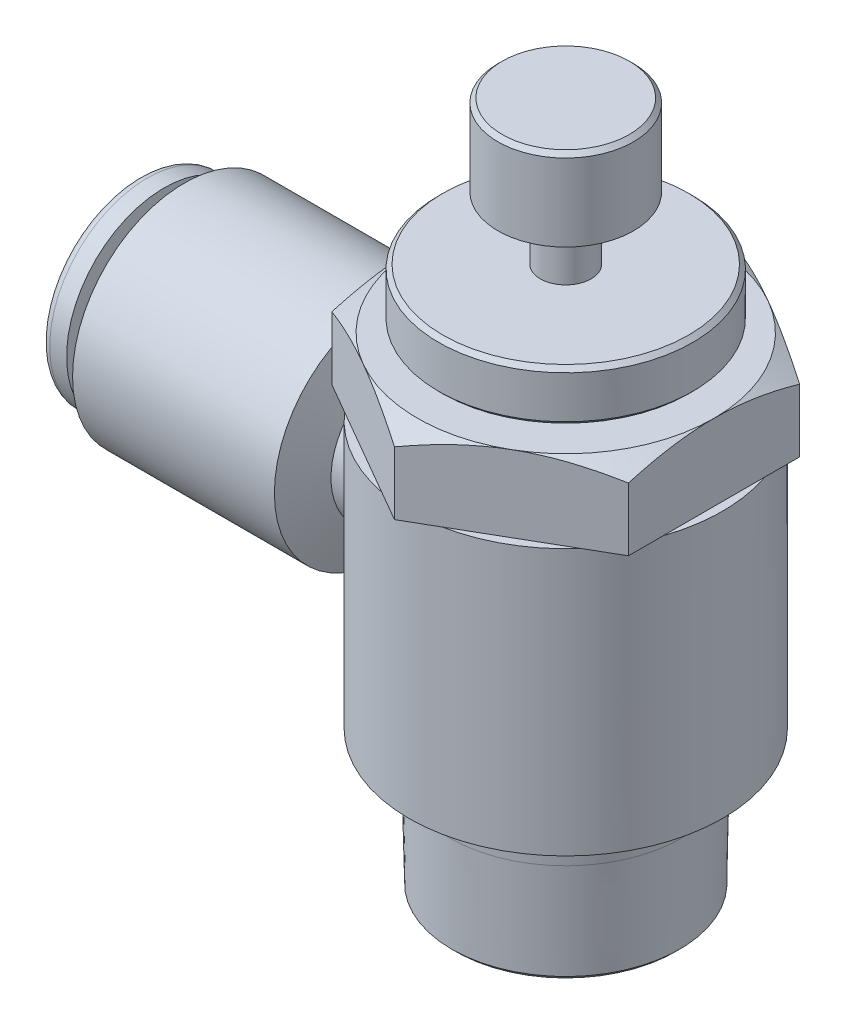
ISO-10303-21;
HEADER;
FILE_DESCRIPTION(('STEP AP214'),'2;1');
FILE_NAME('part.step','',(''),(''),'','','');
FILE_SCHEMA(('AUTOMOTIVE_DESIGN { 1 0 10303 214 1 1 1 1 }'));
ENDSEC;
DATA;
#1=APPLICATION_CONTEXT('core data for automotive mechanical design processes');
#2=APPLICATION_PROTOCOL_DEFINITION('international standard','automotive_design',2000,#1);
#3=PRODUCT_CONTEXT('',#1,'mechanical');
#4=PRODUCT('Part','Part','',(#3));
#5=PRODUCT_RELATED_PRODUCT_CATEGORY('part','',(#4));
#6=PRODUCT_DEFINITION_FORMATION('','',#4);
#7=PRODUCT_DEFINITION_CONTEXT('part definition',#1,'design');
#8=PRODUCT_DEFINITION('design','',#6,#7);
#9=PRODUCT_DEFINITION_SHAPE('','',#8);
#10=(LENGTH_UNIT() NAMED_UNIT(*) SI_UNIT(.MILLI.,.METRE.));
#11=(NAMED_UNIT(*) PLANE_ANGLE_UNIT() SI_UNIT($,.RADIAN.));
#12=(NAMED_UNIT(*) SI_UNIT($,.STERADIAN.) SOLID_ANGLE_UNIT());
#13=UNCERTAINTY_MEASURE_WITH_UNIT(LENGTH_MEASURE(1.E-05),#10,'distance_accuracy_value','');
#14=(GEOMETRIC_REPRESENTATION_CONTEXT(3) GLOBAL_UNCERTAINTY_ASSIGNED_CONTEXT((#13)) GLOBAL_UNIT_ASSIGNED_CONTEXT((#10,
#11,#12)) REPRESENTATION_CONTEXT('',''));
#15=CARTESIAN_POINT('',(0.,0.,0.));
#16=DIRECTION('',(0.,0.,1.));
#17=DIRECTION('',(1.,0.,0.));
#18=AXIS2_PLACEMENT_3D('',#15,#16,#17);
#19=CARTESIAN_POINT('',(0.,-10.,0.));
#20=DIRECTION('',(0.,1.,0.));
#21=DIRECTION('',(0.,0.,1.));
#22=AXIS2_PLACEMENT_3D('',#19,#20,#21);
#23=CONICAL_SURFACE('',#22,6.89740356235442,0.021642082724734);
#24=CARTESIAN_POINT('',(0.,-17.9444689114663,0.));
#25=DIRECTION('',(0.,-1.,0.));
#26=DIRECTION('',(0.,0.,-1.));
#27=AXIS2_PLACEMENT_3D('',#24,#25,#26);
#28=CIRCLE('',#27,6.72544186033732);
#29=CARTESIAN_POINT('',(0.,-17.9444689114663,-6.72544186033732));
#30=VERTEX_POINT('',#29);
#31=EDGE_CURVE('E451',#30,#30,#28,.F.);
#32=ORIENTED_EDGE('',*,*,#31,.T.);
#33=EDGE_LOOP('',(#32));
#34=FACE_BOUND('',#33,.T.);
#35=CARTESIAN_POINT('',(0.,-12.2,0.));
#36=DIRECTION('',(0.,1.,0.));
#37=DIRECTION('',(0.,0.,1.));
#38=AXIS2_PLACEMENT_3D('',#35,#36,#37);
#39=CIRCLE('',#38,6.84978354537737);
#40=CARTESIAN_POINT('',(0.,-12.2,6.84978354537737));
#41=VERTEX_POINT('',#40);
#42=EDGE_CURVE('E14',#41,#41,#39,.F.);
#43=ORIENTED_EDGE('',*,*,#42,.T.);
#44=EDGE_LOOP('',(#43));
#45=FACE_BOUND('',#44,.T.);
#46=ADVANCED_FACE('F47',(#34,#45),#23,.T.);
#47=CARTESIAN_POINT('',(-6.71991077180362,-18.2,0.));
#48=DIRECTION('',(0.,-1.,0.));
#49=DIRECTION('',(0.,0.,-1.));
#50=AXIS2_PLACEMENT_3D('',#47,#48,#49);
#51=PLANE('',#50);
#52=CARTESIAN_POINT('',(0.,-18.2,0.));
#53=DIRECTION('',(0.,-1.,0.));
#54=DIRECTION('',(0.,0.,-1.));
#55=AXIS2_PLACEMENT_3D('',#52,#53,#54);
#56=CIRCLE('',#55,6.46991077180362);
#57=CARTESIAN_POINT('',(0.,-18.2,-6.46991077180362));
#58=VERTEX_POINT('',#57);
#59=EDGE_CURVE('E453',#58,#58,#56,.T.);
#60=ORIENTED_EDGE('',*,*,#59,.T.);
#61=EDGE_LOOP('',(#60));
#62=FACE_BOUND('',#61,.T.);
#63=CARTESIAN_POINT('',(0.,-18.2,0.));
#64=DIRECTION('',(0.,1.,0.));
#65=DIRECTION('',(0.,0.,1.));
#66=AXIS2_PLACEMENT_3D('',#63,#64,#65);
#67=CIRCLE('',#66,1.5875);
#68=CARTESIAN_POINT('',(0.,-18.2,1.5875));
#69=VERTEX_POINT('',#68);
#70=EDGE_CURVE('E989',#69,#69,#67,.T.);
#71=ORIENTED_EDGE('',*,*,#70,.T.);
#72=EDGE_LOOP('',(#71));
#73=FACE_BOUND('',#72,.T.);
#74=ADVANCED_FACE('F249',(#62,#73),#51,.T.);
#75=CARTESIAN_POINT('',(-25.2,0.,0.));
#76=DIRECTION('',(-1.,0.,0.));
#77=DIRECTION('',(0.,0.,1.));
#78=AXIS2_PLACEMENT_3D('',#75,#76,#77);
#79=PLANE('',#78);
#80=CARTESIAN_POINT('',(-25.2,0.,0.));
#81=DIRECTION('',(-1.,0.,0.));
#82=DIRECTION('',(0.,0.,1.));
#83=AXIS2_PLACEMENT_3D('',#80,#81,#82);
#84=CIRCLE('',#83,3.675);
#85=CARTESIAN_POINT('',(-25.2,0.,3.675));
#86=VERTEX_POINT('',#85);
#87=EDGE_CURVE('E456',#86,#86,#84,.F.);
#88=ORIENTED_EDGE('',*,*,#87,.T.);
#89=EDGE_LOOP('',(#88));
#90=FACE_BOUND('',#89,.T.);
#91=CARTESIAN_POINT('',(-25.2,0.,0.));
#92=DIRECTION('',(1.,0.,0.));
#93=DIRECTION('',(0.,0.,-1.));
#94=AXIS2_PLACEMENT_3D('',#91,#92,#93);
#95=CIRCLE('',#94,5.25);
#96=CARTESIAN_POINT('',(-25.2,0.,-5.25));
#97=VERTEX_POINT('',#96);
#98=EDGE_CURVE('E998',#97,#97,#95,.T.);
#99=ORIENTED_EDGE('',*,*,#98,.F.);
#100=EDGE_LOOP('',(#99));
#101=FACE_BOUND('',#100,.T.);
#102=ADVANCED_FACE('F256',(#90,#101),#79,.T.);
#103=CARTESIAN_POINT('',(-7.5,13.7,0.));
#104=DIRECTION('',(0.,-1.,0.));
#105=DIRECTION('',(0.,0.,-1.));
#106=AXIS2_PLACEMENT_3D('',#103,#104,#105);
#107=PLANE('',#106);
#108=CARTESIAN_POINT('',(0.,13.7,0.));
#109=DIRECTION('',(0.,-1.,0.));
#110=DIRECTION('',(0.,0.,-1.));
#111=AXIS2_PLACEMENT_3D('',#108,#109,#110);
#112=CIRCLE('',#111,7.25);
#113=CARTESIAN_POINT('',(0.,13.7,-7.25));
#114=VERTEX_POINT('',#113);
#115=EDGE_CURVE('E442',#114,#114,#112,.F.);
#116=ORIENTED_EDGE('',*,*,#115,.T.);
#117=EDGE_LOOP('',(#116));
#118=FACE_BOUND('',#117,.T.);
#119=CARTESIAN_POINT('',(0.,13.7,0.));
#120=DIRECTION('',(0.,-1.,0.));
#121=DIRECTION('',(0.,0.,-1.));
#122=AXIS2_PLACEMENT_3D('',#119,#120,#121);
#123=CIRCLE('',#122,1.5);
#124=CARTESIAN_POINT('',(0.,13.7,-1.5));
#125=VERTEX_POINT('',#124);
#126=EDGE_CURVE('E448',#125,#125,#123,.F.);
#127=ORIENTED_EDGE('',*,*,#126,.F.);
#128=EDGE_LOOP('',(#127));
#129=FACE_BOUND('',#128,.T.);
#130=ADVANCED_FACE('F498',(#118,#129),#107,.F.);
#131=CARTESIAN_POINT('',(-8.75,10.2,-15.1554445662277));
#132=DIRECTION('',(0.,-1.,0.));
#133=DIRECTION('',(0.,0.,-1.));
#134=AXIS2_PLACEMENT_3D('',#131,#132,#133);
#135=PLANE('',#134);
#136=CARTESIAN_POINT('',(0.,10.2,0.));
#137=DIRECTION('',(0.,-1.,0.));
#138=DIRECTION('',(0.,0.,-1.));
#139=AXIS2_PLACEMENT_3D('',#136,#137,#138);
#140=CIRCLE('',#139,8.75);
#141=CARTESIAN_POINT('',(4.375,10.2,-7.57772228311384));
#142=VERTEX_POINT('',#141);
#143=CARTESIAN_POINT('',(-4.375,10.2,-7.57772228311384));
#144=VERTEX_POINT('',#143);
#145=EDGE_CURVE('E213',#142,#144,#140,.F.);
#146=ORIENTED_EDGE('',*,*,#145,.T.);
#147=CARTESIAN_POINT('',(-8.75,10.2,0.));
#148=VERTEX_POINT('',#147);
#149=EDGE_CURVE('E63',#144,#148,#140,.F.);
#150=ORIENTED_EDGE('',*,*,#149,.T.);
#151=CARTESIAN_POINT('',(-4.375,10.2,7.57772228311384));
#152=VERTEX_POINT('',#151);
#153=EDGE_CURVE('E428',#148,#152,#140,.F.);
#154=ORIENTED_EDGE('',*,*,#153,.T.);
#155=CARTESIAN_POINT('',(4.375,10.2,7.57772228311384));
#156=VERTEX_POINT('',#155);
#157=EDGE_CURVE('E426',#152,#156,#140,.F.);
#158=ORIENTED_EDGE('',*,*,#157,.T.);
#159=CARTESIAN_POINT('',(8.75,10.2,0.));
#160=VERTEX_POINT('',#159);
#161=EDGE_CURVE('E410',#156,#160,#140,.F.);
#162=ORIENTED_EDGE('',*,*,#161,.T.);
#163=CARTESIAN_POINT('',(0.,10.2,0.));
#164=DIRECTION('',(0.,-1.,0.));
#165=DIRECTION('',(0.,0.,-1.));
#166=AXIS2_PLACEMENT_3D('',#163,#164,#165);
#167=CIRCLE('',#166,8.75);
#168=EDGE_CURVE('E161',#142,#160,#167,.T.);
#169=ORIENTED_EDGE('',*,*,#168,.F.);
#170=EDGE_LOOP('',(#146,#150,#154,#158,#162,#169));
#171=FACE_BOUND('',#170,.T.);
#172=CARTESIAN_POINT('',(0.,10.2,0.));
#173=DIRECTION('',(0.,-1.,0.));
#174=DIRECTION('',(0.,0.,-1.));
#175=AXIS2_PLACEMENT_3D('',#172,#173,#174);
#176=CIRCLE('',#175,1.5);
#177=CARTESIAN_POINT('',(0.,10.2,-1.5));
#178=VERTEX_POINT('',#177);
#179=EDGE_CURVE('E431',#178,#178,#176,.F.);
#180=ORIENTED_EDGE('',*,*,#179,.F.);
#181=EDGE_LOOP('',(#180));
#182=FACE_BOUND('',#181,.T.);
#183=ADVANCED_FACE('F243',(#171,#182),#135,.F.);
#184=CARTESIAN_POINT('',(0.,5.7,0.));
#185=DIRECTION('',(0.,1.,0.));
#186=DIRECTION('',(0.,0.,1.));
#187=AXIS2_PLACEMENT_3D('',#184,#185,#186);
#188=PLANE('',#187);
#189=DIRECTION('',(0.,0.,1.));
#190=VECTOR('',#189,1.);
#191=CARTESIAN_POINT('',(-8.75,5.7,-5.05181485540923));
#192=LINE('',#191,#190);
#193=CARTESIAN_POINT('',(-8.75000000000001,5.7,-2.99999999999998));
#194=VERTEX_POINT('',#193);
#195=CARTESIAN_POINT('',(-8.75000000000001,5.7,2.99999999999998));
#196=VERTEX_POINT('',#195);
#197=EDGE_CURVE('E404',#194,#196,#192,.T.);
#198=ORIENTED_EDGE('',*,*,#197,.F.);
#199=CARTESIAN_POINT('',(0.,5.7,0.));
#200=DIRECTION('',(0.,1.,0.));
#201=DIRECTION('',(0.,0.,1.));
#202=AXIS2_PLACEMENT_3D('',#199,#200,#201);
#203=CIRCLE('',#202,9.25);
#204=EDGE_CURVE('E974',#194,#196,#203,.T.);
#205=ORIENTED_EDGE('',*,*,#204,.T.);
#206=EDGE_LOOP('',(#198,#205));
#207=FACE_BOUND('',#206,.T.);
#208=ADVANCED_FACE('F235',(#207),#188,.T.);
#209=DIRECTION('',(-0.866025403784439,0.,0.5));
#210=VECTOR('',#209,1.);
#211=CARTESIAN_POINT('',(0.,5.7,-10.1036297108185));
#212=LINE('',#211,#210);
#213=CARTESIAN_POINT('',(-1.7769237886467,5.7,-9.07772228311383));
#214=VERTEX_POINT('',#213);
#215=CARTESIAN_POINT('',(-6.9730762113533,5.7,-6.07772228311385));
#216=VERTEX_POINT('',#215);
#217=EDGE_CURVE('E384',#214,#216,#212,.T.);
#218=ORIENTED_EDGE('',*,*,#217,.F.);
#219=EDGE_CURVE('E969',#214,#216,#203,.T.);
#220=ORIENTED_EDGE('',*,*,#219,.T.);
#221=EDGE_LOOP('',(#218,#220));
#222=FACE_BOUND('',#221,.T.);
#223=ADVANCED_FACE('F242',(#222),#188,.T.);
#224=DIRECTION('',(-0.866025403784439,0.,-0.5));
#225=VECTOR('',#224,1.);
#226=CARTESIAN_POINT('',(8.75,5.7,-5.05181485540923));
#227=LINE('',#226,#225);
#228=CARTESIAN_POINT('',(6.97307621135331,5.7,-6.07772228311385));
#229=VERTEX_POINT('',#228);
#230=CARTESIAN_POINT('',(1.7769237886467,5.7,-9.07772228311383));
#231=VERTEX_POINT('',#230);
#232=EDGE_CURVE('E389',#229,#231,#227,.T.);
#233=ORIENTED_EDGE('',*,*,#232,.F.);
#234=EDGE_CURVE('E967',#229,#231,#203,.T.);
#235=ORIENTED_EDGE('',*,*,#234,.T.);
#236=EDGE_LOOP('',(#233,#235));
#237=FACE_BOUND('',#236,.T.);
#238=ADVANCED_FACE('F912',(#237),#188,.T.);
#239=DIRECTION('',(0.,0.,-1.));
#240=VECTOR('',#239,1.);
#241=CARTESIAN_POINT('',(8.75,5.7,5.05181485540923));
#242=LINE('',#241,#240);
#243=CARTESIAN_POINT('',(8.75,5.7,3.));
#244=VERTEX_POINT('',#243);
#245=CARTESIAN_POINT('',(8.75,5.7,-3.));
#246=VERTEX_POINT('',#245);
#247=EDGE_CURVE('E393',#244,#246,#242,.T.);
#248=ORIENTED_EDGE('',*,*,#247,.F.);
#249=EDGE_CURVE('E963',#244,#246,#203,.T.);
#250=ORIENTED_EDGE('',*,*,#249,.T.);
#251=EDGE_LOOP('',(#248,#250));
#252=FACE_BOUND('',#251,.T.);
#253=ADVANCED_FACE('F246',(#252),#188,.T.);
#254=DIRECTION('',(0.866025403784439,0.,-0.5));
#255=VECTOR('',#254,1.);
#256=CARTESIAN_POINT('',(0.,5.7,10.1036297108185));
#257=LINE('',#256,#255);
#258=CARTESIAN_POINT('',(1.77692378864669,5.7,9.07772228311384));
#259=VERTEX_POINT('',#258);
#260=CARTESIAN_POINT('',(6.97307621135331,5.7,6.07772228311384));
#261=VERTEX_POINT('',#260);
#262=EDGE_CURVE('E398',#259,#261,#257,.T.);
#263=ORIENTED_EDGE('',*,*,#262,.F.);
#264=EDGE_CURVE('E202',#259,#261,#203,.T.);
#265=ORIENTED_EDGE('',*,*,#264,.T.);
#266=EDGE_LOOP('',(#263,#265));
#267=FACE_BOUND('',#266,.T.);
#268=ADVANCED_FACE('F236',(#267),#188,.T.);
#269=CARTESIAN_POINT('',(0.,5.7,0.));
#270=DIRECTION('',(0.,-1.,0.));
#271=DIRECTION('',(0.,0.,-1.));
#272=AXIS2_PLACEMENT_3D('',#269,#270,#271);
#273=CYLINDRICAL_SURFACE('',#272,9.25);
#274=CARTESIAN_POINT('',(-8.26680107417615,0.,-4.15));
#275=CARTESIAN_POINT('',(-8.26680209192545,0.109805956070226,-4.14999908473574));
#276=CARTESIAN_POINT('',(-8.26899659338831,0.219640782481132,-4.14563549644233));
#277=CARTESIAN_POINT('',(-8.27769917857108,0.438493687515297,-4.12823053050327));
#278=CARTESIAN_POINT('',(-8.28420978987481,0.547511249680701,-4.11518406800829));
#279=CARTESIAN_POINT('',(-8.30133385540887,0.764074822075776,-4.08053078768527));
#280=CARTESIAN_POINT('',(-8.31195525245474,0.87161756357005,-4.05890739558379));
#281=CARTESIAN_POINT('',(-8.33693282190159,1.08426436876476,-4.00735108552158));
#282=CARTESIAN_POINT('',(-8.35129058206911,1.18936737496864,-3.97741463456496));
#283=CARTESIAN_POINT('',(-8.39913731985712,1.49892878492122,-3.8759030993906));
#284=CARTESIAN_POINT('',(-8.43750548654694,1.69887013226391,-3.79242500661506));
#285=CARTESIAN_POINT('',(-8.52283504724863,2.0817582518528,-3.59654305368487));
#286=CARTESIAN_POINT('',(-8.5697953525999,2.26470717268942,-3.48414285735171));
#287=CARTESIAN_POINT('',(-8.67081454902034,2.62188145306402,-3.22491430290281));
#288=CARTESIAN_POINT('',(-8.72513715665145,2.7947424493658,-3.0763082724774));
#289=CARTESIAN_POINT('',(-8.83263210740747,3.11417128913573,-2.75247705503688));
#290=CARTESIAN_POINT('',(-8.88580395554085,3.26072800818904,-2.57724066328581));
#291=CARTESIAN_POINT('',(-8.96198687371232,3.46139931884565,-2.2925261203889));
#292=CARTESIAN_POINT('',(-8.98735727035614,3.52642564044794,-2.19120258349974));
#293=CARTESIAN_POINT('',(-9.03560698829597,3.6476415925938,-1.98285531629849));
#294=CARTESIAN_POINT('',(-9.0584873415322,3.7038348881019,-1.87583397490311));
#295=CARTESIAN_POINT('',(-9.1011020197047,3.80686985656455,-1.65677331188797));
#296=CARTESIAN_POINT('',(-9.12083617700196,3.85371103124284,-1.54473372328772));
#297=CARTESIAN_POINT('',(-9.15656355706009,3.9375238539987,-1.31650009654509));
#298=CARTESIAN_POINT('',(-9.17255872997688,3.97450064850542,-1.20030826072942));
#299=CARTESIAN_POINT('',(-9.1995112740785,4.03630200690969,-0.971578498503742));
#300=CARTESIAN_POINT('',(-9.21070951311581,4.06171314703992,-0.859227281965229));
#301=CARTESIAN_POINT('',(-9.22904840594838,4.10313052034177,-0.632526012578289));
#302=CARTESIAN_POINT('',(-9.23619093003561,4.11914108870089,-0.518176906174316));
#303=CARTESIAN_POINT('',(-9.24621882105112,4.1415774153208,-0.288377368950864));
#304=CARTESIAN_POINT('',(-9.24910499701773,4.14800499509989,-0.172927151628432));
#305=CARTESIAN_POINT('',(-9.250538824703,4.15120108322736,0.0581296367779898));
#306=CARTESIAN_POINT('',(-9.24908667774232,4.14797003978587,0.173736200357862));
#307=CARTESIAN_POINT('',(-9.24214003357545,4.13245660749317,0.396001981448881));
#308=CARTESIAN_POINT('',(-9.23693831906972,4.12082969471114,0.502716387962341));
#309=CARTESIAN_POINT('',(-9.22296093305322,4.08940053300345,0.71470696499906));
#310=CARTESIAN_POINT('',(-9.21418409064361,4.06959560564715,0.81998265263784));
#311=CARTESIAN_POINT('',(-9.18278902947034,3.99818916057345,1.13248812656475));
#312=CARTESIAN_POINT('',(-9.15509907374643,3.93458082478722,1.33660761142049));
#313=CARTESIAN_POINT('',(-9.08828976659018,3.77653041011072,1.73402373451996));
#314=CARTESIAN_POINT('',(-9.04900304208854,3.68163423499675,1.92710863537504));
#315=CARTESIAN_POINT('',(-8.96272934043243,3.46416896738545,2.29515338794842));
#316=CARTESIAN_POINT('',(-8.91573955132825,3.34158976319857,2.47010658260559));
#317=CARTESIAN_POINT('',(-8.8142472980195,3.06095168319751,2.81172614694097));
#318=CARTESIAN_POINT('',(-8.75944455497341,2.9008418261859,2.97661645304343));
#319=CARTESIAN_POINT('',(-8.65113884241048,2.55520198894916,3.27810862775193));
#320=CARTESIAN_POINT('',(-8.59763655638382,2.36965896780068,3.41469589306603));
#321=CARTESIAN_POINT('',(-8.52173331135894,2.07117449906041,3.59822374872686));
#322=CARTESIAN_POINT('',(-8.49668658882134,1.96590353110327,3.65681509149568));
#323=CARTESIAN_POINT('',(-8.44938224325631,1.75017624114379,3.7648256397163));
#324=CARTESIAN_POINT('',(-8.42712338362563,1.63972224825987,3.81424891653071));
#325=CARTESIAN_POINT('',(-8.38618840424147,1.41436571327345,3.90342863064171));
#326=CARTESIAN_POINT('',(-8.36751148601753,1.29946416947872,3.94318722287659));
#327=CARTESIAN_POINT('',(-8.33446058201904,1.06609516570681,4.01257352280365));
#328=CARTESIAN_POINT('',(-8.3200841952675,0.947629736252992,4.04220688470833));
#329=CARTESIAN_POINT('',(-8.29706279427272,0.716595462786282,4.08924007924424));
#330=CARTESIAN_POINT('',(-8.28808293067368,0.604206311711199,4.10735996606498));
#331=CARTESIAN_POINT('',(-8.27467414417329,0.378098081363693,4.13430722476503));
#332=CARTESIAN_POINT('',(-8.27024306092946,0.264379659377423,4.14313900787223));
#333=CARTESIAN_POINT('',(-8.26609722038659,0.0365354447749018,4.15140438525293));
#334=CARTESIAN_POINT('',(-8.26638164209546,-0.077590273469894,4.15083961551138));
#335=CARTESIAN_POINT('',(-8.2716533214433,-0.305294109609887,4.14032432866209));
#336=CARTESIAN_POINT('',(-8.27664038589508,-0.41887224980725,4.13037419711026));
#337=CARTESIAN_POINT('',(-8.29054727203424,-0.635541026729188,4.10238324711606));
#338=CARTESIAN_POINT('',(-8.29912192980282,-0.738745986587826,4.08505055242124));
#339=CARTESIAN_POINT('',(-8.31981404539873,-0.943226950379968,4.04273924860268));
#340=CARTESIAN_POINT('',(-8.33193270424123,-1.04450228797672,4.01775804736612));
#341=CARTESIAN_POINT('',(-8.37307727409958,-1.34443380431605,3.93168913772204));
#342=CARTESIAN_POINT('',(-8.40690285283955,-1.5393545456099,3.85945519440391));
#343=CARTESIAN_POINT('',(-8.48536485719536,-1.92312868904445,3.6838400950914));
#344=CARTESIAN_POINT('',(-8.53041952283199,-2.11131359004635,3.57920279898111));
#345=CARTESIAN_POINT('',(-8.62575872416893,-2.46847374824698,3.34290294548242));
#346=CARTESIAN_POINT('',(-8.67604574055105,-2.63743981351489,3.21122754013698));
#347=CARTESIAN_POINT('',(-8.78206509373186,-2.96843673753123,2.90960438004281));
#348=CARTESIAN_POINT('',(-8.83785175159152,-3.12819841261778,2.73718100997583));
#349=CARTESIAN_POINT('',(-8.9441857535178,-3.41709438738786,2.36665501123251));
#350=CARTESIAN_POINT('',(-8.99473229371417,-3.54622399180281,2.16854845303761));
#351=CARTESIAN_POINT('',(-9.0627645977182,-3.71434147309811,1.85485519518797));
#352=CARTESIAN_POINT('',(-9.08423750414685,-3.76632555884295,1.74691386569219));
#353=CARTESIAN_POINT('',(-9.1238698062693,-3.8609394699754,1.52643735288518));
#354=CARTESIAN_POINT('',(-9.14203065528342,-3.90357339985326,1.4139042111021));
#355=CARTESIAN_POINT('',(-9.17449721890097,-3.97901458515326,1.18509687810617));
#356=CARTESIAN_POINT('',(-9.18880426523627,-4.01182523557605,1.06882399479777));
#357=CARTESIAN_POINT('',(-9.21313632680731,-4.06724757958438,0.833433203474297));
#358=CARTESIAN_POINT('',(-9.22316172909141,-4.08986019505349,0.714315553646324));
#359=CARTESIAN_POINT('',(-9.23800652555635,-4.12322297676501,0.483747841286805));
#360=CARTESIAN_POINT('',(-9.24317435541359,-4.13476853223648,0.372434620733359));
#361=CARTESIAN_POINT('',(-9.24947332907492,-4.14883082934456,0.149083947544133));
#362=CARTESIAN_POINT('',(-9.25060312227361,-4.15134455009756,0.0370462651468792));
#363=CARTESIAN_POINT('',(-9.24879103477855,-4.14730498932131,-0.186765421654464));
#364=CARTESIAN_POINT('',(-9.2458515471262,-4.14075703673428,-0.298539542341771));
#365=CARTESIAN_POINT('',(-9.23598435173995,-4.11867745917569,-0.521059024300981));
#366=CARTESIAN_POINT('',(-9.22905516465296,-4.10314250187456,-0.631803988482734));
#367=CARTESIAN_POINT('',(-9.21180245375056,-4.06418449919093,-0.846301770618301));
#368=CARTESIAN_POINT('',(-9.2016509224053,-4.04115992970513,-0.950140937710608));
#369=CARTESIAN_POINT('',(-9.17813698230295,-3.98732706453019,-1.15542231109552));
#370=CARTESIAN_POINT('',(-9.16477345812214,-3.956516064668,-1.25686367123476));
#371=CARTESIAN_POINT('',(-9.12031822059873,-3.85281233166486,-1.55658030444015));
#372=CARTESIAN_POINT('',(-9.08484674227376,-3.76861608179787,-1.75042623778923));
#373=CARTESIAN_POINT('',(-9.0035733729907,-3.56834221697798,-2.1301849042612));
#374=CARTESIAN_POINT('',(-8.95737265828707,-3.45098071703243,-2.31532732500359));
#375=CARTESIAN_POINT('',(-8.85989259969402,-3.18942147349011,-2.66413637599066));
#376=CARTESIAN_POINT('',(-8.80861108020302,-3.04521221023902,-2.82779373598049));
#377=CARTESIAN_POINT('',(-8.70148482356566,-2.72051428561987,-3.14269278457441));
#378=CARTESIAN_POINT('',(-8.64560470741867,-2.53804091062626,-3.29187822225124));
#379=CARTESIAN_POINT('',(-8.53952734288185,-2.14904383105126,-3.55802955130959));
#380=CARTESIAN_POINT('',(-8.48933373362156,-1.94250489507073,-3.67497487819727));
#381=CARTESIAN_POINT('',(-8.42297604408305,-1.61799029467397,-3.823470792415));
#382=CARTESIAN_POINT('',(-8.40229120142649,-1.50696883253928,-3.86858838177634));
#383=CARTESIAN_POINT('',(-8.36470425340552,-1.28088636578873,-3.94920308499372));
#384=CARTESIAN_POINT('',(-8.34780024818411,-1.16582742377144,-3.98470503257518));
#385=CARTESIAN_POINT('',(-8.31846534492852,-0.93284093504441,-4.04558706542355));
#386=CARTESIAN_POINT('',(-8.3060227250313,-0.814921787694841,-4.07099369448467));
#387=CARTESIAN_POINT('',(-8.28606466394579,-0.576970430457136,-4.11146535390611));
#388=CARTESIAN_POINT('',(-8.27854553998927,-0.45693986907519,-4.12653811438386));
#389=CARTESIAN_POINT('',(-8.27136895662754,-0.28049526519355,-4.14089065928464));
#390=CARTESIAN_POINT('',(-8.26965786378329,-0.224468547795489,-4.14430512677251));
#391=CARTESIAN_POINT('',(-8.26737364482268,-0.112297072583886,-4.14886006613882));
#392=CARTESIAN_POINT('',(-8.26680055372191,-0.0561523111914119,-4.15000046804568));
#393=CARTESIAN_POINT('',(-8.26680107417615,0.,-4.15));
#394=B_SPLINE_CURVE_WITH_KNOTS('',3,(#274,#275,#276,#277,#278,#279,#280,#281,#282,#283,#284,
#285,#286,#287,#288,#289,#290,#291,#292,#293,#294,#295,#296,#297,#298,#299,#300,#301,#302,#303,
#304,#305,#306,#307,#308,#309,#310,#311,#312,#313,#314,#315,#316,#317,#318,#319,#320,#321,#322,
#323,#324,#325,#326,#327,#328,#329,#330,#331,#332,#333,#334,#335,#336,#337,#338,#339,#340,#341,
#342,#343,#344,#345,#346,#347,#348,#349,#350,#351,#352,#353,#354,#355,#356,#357,#358,#359,#360,
#361,#362,#363,#364,#365,#366,#367,#368,#369,#370,#371,#372,#373,#374,#375,#376,#377,#378,#379,
#380,#381,#382,#383,#384,#385,#386,#387,#388,#389,#390,#391,#392,#393),.UNSPECIFIED.,.T.,.F.,(4,
2,2,2,2,2,2,2,2,2,2,2,2,2,2,2,2,2,2,2,2,2,2,2,2,2,2,2,2,2,2,2,2,2,2,2,2,2,2,2,2,2,2,2,2,2,2,2,2,
2,2,2,2,2,2,2,2,2,2,4),(0.,0.329359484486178,0.658912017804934,0.989104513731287,
1.31943755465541,1.97639717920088,2.63327362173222,3.33333747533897,4.03369670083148,
4.40241662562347,4.77098315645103,5.13956931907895,5.50796280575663,5.85470088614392,
6.20127893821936,6.54779110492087,6.89428719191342,7.21630803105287,7.53843442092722,
8.18205928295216,8.83546990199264,9.4891195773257,10.194942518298,10.9011287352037,
11.2698899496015,11.6384870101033,12.0070018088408,12.375310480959,12.7174299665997,
13.059386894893,13.4012842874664,13.743167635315,14.0577996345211,14.3725383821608,
15.0015391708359,15.6588651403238,16.3165041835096,17.0380445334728,17.7596954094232,
18.1244365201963,18.4890171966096,18.8534717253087,19.2178933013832,19.5535527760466,
19.8893245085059,20.2248988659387,20.5605977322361,20.8807553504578,21.2010243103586,
21.841023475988,22.5103433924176,23.1799511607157,23.9033975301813,24.6273042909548,
24.9917199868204,25.3559521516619,25.7192201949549,26.0822162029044,26.2506380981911,
26.4190651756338),.UNSPECIFIED.);
#395=CARTESIAN_POINT('',(-8.26680107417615,0.,-4.15));
#396=VERTEX_POINT('',#395);
#397=EDGE_CURVE('E197',#396,#396,#394,.T.);
#398=ORIENTED_EDGE('',*,*,#397,.T.);
#399=EDGE_LOOP('',(#398));
#400=FACE_BOUND('',#399,.T.);
#401=ORIENTED_EDGE('',*,*,#264,.F.);
#402=CARTESIAN_POINT('',(-1.77692378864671,5.7,9.07772228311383));
#403=VERTEX_POINT('',#402);
#404=EDGE_CURVE('E201',#403,#259,#203,.T.);
#405=ORIENTED_EDGE('',*,*,#404,.F.);
#406=CARTESIAN_POINT('',(-6.97307621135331,5.7,6.07772228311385));
#407=VERTEX_POINT('',#406);
#408=EDGE_CURVE('E560',#407,#403,#203,.T.);
#409=ORIENTED_EDGE('',*,*,#408,.F.);
#410=EDGE_CURVE('E976',#196,#407,#203,.T.);
#411=ORIENTED_EDGE('',*,*,#410,.F.);
#412=ORIENTED_EDGE('',*,*,#204,.F.);
#413=EDGE_CURVE('E971',#216,#194,#203,.T.);
#414=ORIENTED_EDGE('',*,*,#413,.F.);
#415=ORIENTED_EDGE('',*,*,#219,.F.);
#416=EDGE_CURVE('E418',#231,#214,#203,.T.);
#417=ORIENTED_EDGE('',*,*,#416,.F.);
#418=ORIENTED_EDGE('',*,*,#234,.F.);
#419=EDGE_CURVE('E966',#246,#229,#203,.T.);
#420=ORIENTED_EDGE('',*,*,#419,.F.);
#421=ORIENTED_EDGE('',*,*,#249,.F.);
#422=EDGE_CURVE('E206',#261,#244,#203,.T.);
#423=ORIENTED_EDGE('',*,*,#422,.F.);
#424=EDGE_LOOP('',(#401,#405,#409,#411,#412,#414,#415,#417,#418,#420,#421,#423));
#425=FACE_BOUND('',#424,.T.);
#426=CARTESIAN_POINT('',(0.,-10.,0.));
#427=DIRECTION('',(0.,1.,0.));
#428=DIRECTION('',(0.,0.,1.));
#429=AXIS2_PLACEMENT_3D('',#426,#427,#428);
#430=CIRCLE('',#429,9.25);
#431=CARTESIAN_POINT('',(0.,-10.,9.25));
#432=VERTEX_POINT('',#431);
#433=EDGE_CURVE('E198',#432,#432,#430,.T.);
#434=ORIENTED_EDGE('',*,*,#433,.T.);
#435=EDGE_LOOP('',(#434));
#436=FACE_BOUND('',#435,.T.);
#437=ADVANCED_FACE('F215',(#400,#425,#436),#273,.T.);
#438=DIRECTION('',(0.866025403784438,0.,0.5));
#439=VECTOR('',#438,1.);
#440=CARTESIAN_POINT('',(-8.75000000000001,5.7,5.05181485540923));
#441=LINE('',#440,#439);
#442=EDGE_CURVE('E205',#407,#403,#441,.T.);
#443=ORIENTED_EDGE('',*,*,#442,.F.);
#444=ORIENTED_EDGE('',*,*,#408,.T.);
#445=EDGE_LOOP('',(#443,#444));
#446=FACE_BOUND('',#445,.T.);
#447=ADVANCED_FACE('F231',(#446),#188,.T.);
#448=CARTESIAN_POINT('',(0.,-10.,0.));
#449=DIRECTION('',(0.,1.,0.));
#450=DIRECTION('',(0.,0.,1.));
#451=AXIS2_PLACEMENT_3D('',#448,#449,#450);
#452=PLANE('',#451);
#453=CARTESIAN_POINT('',(0.,-10.,0.));
#454=DIRECTION('',(0.,1.,0.));
#455=DIRECTION('',(0.,0.,1.));
#456=AXIS2_PLACEMENT_3D('',#453,#454,#455);
#457=CIRCLE('',#456,6.89740356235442);
#458=CARTESIAN_POINT('',(0.,-10.,6.89740356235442));
#459=VERTEX_POINT('',#458);
#460=EDGE_CURVE('E280',#459,#459,#457,.T.);
#461=ORIENTED_EDGE('',*,*,#460,.T.);
#462=EDGE_LOOP('',(#461));
#463=FACE_BOUND('',#462,.T.);
#464=ORIENTED_EDGE('',*,*,#433,.F.);
#465=EDGE_LOOP('',(#464));
#466=FACE_BOUND('',#465,.T.);
#467=ADVANCED_FACE('F225',(#463,#466),#452,.F.);
#468=CARTESIAN_POINT('',(-21.4379725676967,0.,0.));
#469=DIRECTION('',(1.,0.,0.));
#470=DIRECTION('',(0.,0.,-1.));
#471=AXIS2_PLACEMENT_3D('',#468,#469,#470);
#472=CYLINDRICAL_SURFACE('',#471,4.15);
#473=CARTESIAN_POINT('',(-9.7,0.,0.));
#474=DIRECTION('',(1.,0.,0.));
#475=DIRECTION('',(0.,0.,-1.));
#476=AXIS2_PLACEMENT_3D('',#473,#474,#475);
#477=CIRCLE('',#476,4.15);
#478=CARTESIAN_POINT('',(-9.7,0.,-4.15));
#479=VERTEX_POINT('',#478);
#480=EDGE_CURVE('E194',#479,#479,#477,.F.);
#481=ORIENTED_EDGE('',*,*,#480,.F.);
#482=EDGE_LOOP('',(#481));
#483=FACE_BOUND('',#482,.T.);
#484=ORIENTED_EDGE('',*,*,#397,.F.);
#485=EDGE_LOOP('',(#484));
#486=FACE_BOUND('',#485,.T.);
#487=ADVANCED_FACE('F219',(#483,#486),#472,.T.);
#488=CARTESIAN_POINT('',(-8.75,5.7,-15.1554445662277));
#489=DIRECTION('',(0.,-1.,0.));
#490=DIRECTION('',(0.,0.,-1.));
#491=AXIS2_PLACEMENT_3D('',#488,#489,#490);
#492=PLANE('',#491);
#493=CARTESIAN_POINT('',(8.75,5.7,5.05181485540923));
#494=VERTEX_POINT('',#493);
#495=EDGE_CURVE('E397',#261,#494,#257,.T.);
#496=ORIENTED_EDGE('',*,*,#495,.F.);
#497=ORIENTED_EDGE('',*,*,#422,.T.);
#498=EDGE_CURVE('E390',#494,#244,#242,.T.);
#499=ORIENTED_EDGE('',*,*,#498,.F.);
#500=EDGE_LOOP('',(#496,#497,#499));
#501=FACE_BOUND('',#500,.T.);
#502=ADVANCED_FACE('F224',(#501),#492,.T.);
#503=CARTESIAN_POINT('',(8.75,5.7,-5.05181485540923));
#504=VERTEX_POINT('',#503);
#505=EDGE_CURVE('E180',#246,#504,#242,.T.);
#506=ORIENTED_EDGE('',*,*,#505,.F.);
#507=ORIENTED_EDGE('',*,*,#419,.T.);
#508=EDGE_CURVE('E386',#504,#229,#227,.T.);
#509=ORIENTED_EDGE('',*,*,#508,.F.);
#510=EDGE_LOOP('',(#506,#507,#509));
#511=FACE_BOUND('',#510,.T.);
#512=ADVANCED_FACE('F644',(#511),#492,.T.);
#513=CARTESIAN_POINT('',(0.,5.7,-10.1036297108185));
#514=VERTEX_POINT('',#513);
#515=EDGE_CURVE('E388',#231,#514,#227,.T.);
#516=ORIENTED_EDGE('',*,*,#515,.F.);
#517=ORIENTED_EDGE('',*,*,#416,.T.);
#518=EDGE_CURVE('E381',#514,#214,#212,.T.);
#519=ORIENTED_EDGE('',*,*,#518,.F.);
#520=EDGE_LOOP('',(#516,#517,#519));
#521=FACE_BOUND('',#520,.T.);
#522=ADVANCED_FACE('F417',(#521),#492,.T.);
#523=CARTESIAN_POINT('',(-8.75,5.7,-5.05181485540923));
#524=VERTEX_POINT('',#523);
#525=EDGE_CURVE('E376',#216,#524,#212,.T.);
#526=ORIENTED_EDGE('',*,*,#525,.F.);
#527=ORIENTED_EDGE('',*,*,#413,.T.);
#528=EDGE_CURVE('E402',#524,#194,#192,.T.);
#529=ORIENTED_EDGE('',*,*,#528,.F.);
#530=EDGE_LOOP('',(#526,#527,#529));
#531=FACE_BOUND('',#530,.T.);
#532=ADVANCED_FACE('F634',(#531),#492,.T.);
#533=CARTESIAN_POINT('',(-8.75000000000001,5.7,5.05181485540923));
#534=VERTEX_POINT('',#533);
#535=EDGE_CURVE('E403',#196,#534,#192,.T.);
#536=ORIENTED_EDGE('',*,*,#535,.F.);
#537=ORIENTED_EDGE('',*,*,#410,.T.);
#538=EDGE_CURVE('E399',#534,#407,#441,.T.);
#539=ORIENTED_EDGE('',*,*,#538,.F.);
#540=EDGE_LOOP('',(#536,#537,#539));
#541=FACE_BOUND('',#540,.T.);
#542=ADVANCED_FACE('F370',(#541),#492,.T.);
#543=CARTESIAN_POINT('',(-8.75,10.2,-5.05181485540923));
#544=DIRECTION('',(1.,0.,0.));
#545=DIRECTION('',(0.,0.,-1.));
#546=AXIS2_PLACEMENT_3D('',#543,#544,#545);
#547=PLANE('',#546);
#548=DIRECTION('',(0.,-1.,0.));
#549=VECTOR('',#548,1.);
#550=CARTESIAN_POINT('',(-8.75000000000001,10.2,5.05181485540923));
#551=LINE('',#550,#549);
#552=CARTESIAN_POINT('',(-8.75,9.41848152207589,5.05181485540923));
#553=VERTEX_POINT('',#552);
#554=EDGE_CURVE('E192',#553,#534,#551,.T.);
#555=ORIENTED_EDGE('',*,*,#554,.F.);
#556=CARTESIAN_POINT('',(-8.75,6.01289132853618,-13.398157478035));
#557=CARTESIAN_POINT('',(-8.75,6.1057400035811,-13.2060773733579));
#558=CARTESIAN_POINT('',(-8.75,6.19810814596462,-13.0137650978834));
#559=CARTESIAN_POINT('',(-8.75,6.38177306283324,-12.6286271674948));
#560=CARTESIAN_POINT('',(-8.75,6.47306982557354,-12.4358015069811));
#561=CARTESIAN_POINT('',(-8.75,6.74521405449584,-11.8564243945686));
#562=CARTESIAN_POINT('',(-8.75,6.92428518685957,-11.4690352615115));
#563=CARTESIAN_POINT('',(-8.75,7.27755915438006,-10.6893631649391));
#564=CARTESIAN_POINT('',(-8.75,7.45172826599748,-10.2970648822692));
#565=CARTESIAN_POINT('',(-8.75,7.79258846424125,-9.50924466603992));
#566=CARTESIAN_POINT('',(-8.75,7.95927994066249,-9.11372290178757));
#567=CARTESIAN_POINT('',(-8.75,8.28517068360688,-8.31391542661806));
#568=CARTESIAN_POINT('',(-8.75,8.44425284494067,-7.90958173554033));
#569=CARTESIAN_POINT('',(-8.75,8.74995821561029,-7.09614631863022));
#570=CARTESIAN_POINT('',(-8.75,8.89658003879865,-6.68704406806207));
#571=CARTESIAN_POINT('',(-8.75,9.17342418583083,-5.86425581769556));
#572=CARTESIAN_POINT('',(-8.75,9.30368137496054,-5.45058167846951));
#573=CARTESIAN_POINT('',(-8.75,9.54356814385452,-4.61736734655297));
#574=CARTESIAN_POINT('',(-8.75,9.65320424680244,-4.19782905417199));
#575=CARTESIAN_POINT('',(-8.75,9.84651830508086,-3.35252975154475));
#576=CARTESIAN_POINT('',(-8.75,9.93018934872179,-2.92676711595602));
#577=CARTESIAN_POINT('',(-8.75,10.0320326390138,-2.28437661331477));
#578=CARTESIAN_POINT('',(-8.75,10.0620387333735,-2.06959566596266));
#579=CARTESIAN_POINT('',(-8.75,10.1135727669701,-1.63902678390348));
#580=CARTESIAN_POINT('',(-8.75,10.1351015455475,-1.42323895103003));
#581=CARTESIAN_POINT('',(-8.75,10.1691015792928,-0.992316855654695));
#582=CARTESIAN_POINT('',(-8.75,10.1816290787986,-0.777187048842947));
#583=CARTESIAN_POINT('',(-8.75,10.197560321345,-0.346589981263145));
#584=CARTESIAN_POINT('',(-8.75000000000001,10.2009641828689,-0.131122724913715));
#585=CARTESIAN_POINT('',(-8.75000000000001,10.1985670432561,0.299700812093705));
#586=CARTESIAN_POINT('',(-8.75000000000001,10.1927686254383,0.515057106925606));
#587=CARTESIAN_POINT('',(-8.75000000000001,10.1721111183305,0.945337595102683));
#588=CARTESIAN_POINT('',(-8.75000000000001,10.1572515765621,1.16026176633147));
#589=CARTESIAN_POINT('',(-8.75000000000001,10.1105656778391,1.68117178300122));
#590=CARTESIAN_POINT('',(-8.75000000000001,10.0741993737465,1.98675740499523));
#591=CARTESIAN_POINT('',(-8.75000000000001,9.98516747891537,2.59558697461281));
#592=CARTESIAN_POINT('',(-8.75000000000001,9.93249743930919,2.89883025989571));
#593=CARTESIAN_POINT('',(-8.75000000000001,9.81272611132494,3.50272498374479));
#594=CARTESIAN_POINT('',(-8.75000000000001,9.74561117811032,3.80337369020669));
#595=CARTESIAN_POINT('',(-8.75000000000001,9.59899781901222,4.40157785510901));
#596=CARTESIAN_POINT('',(-8.75000000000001,9.51950055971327,4.69913360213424));
#597=CARTESIAN_POINT('',(-8.75000000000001,9.34794638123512,5.29848058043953));
#598=CARTESIAN_POINT('',(-8.75000000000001,9.25562936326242,5.60019684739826));
#599=CARTESIAN_POINT('',(-8.75000000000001,9.06187387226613,6.20044023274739));
#600=CARTESIAN_POINT('',(-8.75000000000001,8.96044169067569,6.49896939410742));
#601=CARTESIAN_POINT('',(-8.75000000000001,8.75055105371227,7.09164067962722));
#602=CARTESIAN_POINT('',(-8.75000000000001,8.64213536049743,7.38579803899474));
#603=CARTESIAN_POINT('',(-8.75000000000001,8.41894059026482,7.97183050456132));
#604=CARTESIAN_POINT('',(-8.75000000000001,8.30415894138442,8.26370463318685));
#605=CARTESIAN_POINT('',(-8.75000000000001,8.18682404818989,8.55451841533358));
#606=B_SPLINE_CURVE_WITH_KNOTS('',3,(#556,#557,#558,#559,#560,#561,#562,#563,#564,#565,#566,
#567,#568,#569,#570,#571,#572,#573,#574,#575,#576,#577,#578,#579,#580,#581,#582,#583,#584,#585,
#586,#587,#588,#589,#590,#591,#592,#593,#594,#595,#596,#597,#598,#599,#600,#601,#602,#603,#604,
#605),.UNSPECIFIED.,.F.,.F.,(4,2,2,2,2,2,2,2,2,2,2,2,2,2,2,2,2,2,2,2,2,2,2,2,4),(0.,
0.640030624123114,1.280068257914,2.56035171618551,3.8479617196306,5.13550452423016,
6.43885435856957,7.74234899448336,9.04301762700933,10.3432741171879,11.6438764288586,
12.2943358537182,12.9447308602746,13.591025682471,14.2373121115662,14.8834171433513,
15.5295544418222,16.4522659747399,17.3752295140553,18.2990687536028,19.2228210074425,
20.1692164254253,21.1149635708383,22.0553874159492,22.9961940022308),.UNSPECIFIED.);
#607=EDGE_CURVE('E175',#553,#148,#606,.F.);
#608=ORIENTED_EDGE('',*,*,#607,.T.);
#609=CARTESIAN_POINT('',(-8.75,9.41848152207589,-5.05181485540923));
#610=VERTEX_POINT('',#609);
#611=EDGE_CURVE('E329',#148,#610,#606,.F.);
#612=ORIENTED_EDGE('',*,*,#611,.T.);
#613=DIRECTION('',(0.,-1.,0.));
#614=VECTOR('',#613,1.);
#615=CARTESIAN_POINT('',(-8.75,10.2,-5.05181485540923));
#616=LINE('',#615,#614);
#617=EDGE_CURVE('E187',#610,#524,#616,.T.);
#618=ORIENTED_EDGE('',*,*,#617,.T.);
#619=ORIENTED_EDGE('',*,*,#528,.T.);
#620=ORIENTED_EDGE('',*,*,#197,.T.);
#621=ORIENTED_EDGE('',*,*,#535,.T.);
#622=EDGE_LOOP('',(#555,#608,#612,#618,#619,#620,#621));
#623=FACE_BOUND('',#622,.T.);
#624=ADVANCED_FACE('F227',(#623),#547,.F.);
#625=CARTESIAN_POINT('',(-8.75000000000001,10.2,5.05181485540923));
#626=DIRECTION('',(0.5,0.,-0.866025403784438));
#627=DIRECTION('',(-0.866025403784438,0.,-0.5));
#628=AXIS2_PLACEMENT_3D('',#625,#626,#627);
#629=PLANE('',#628);
#630=DIRECTION('',(0.,-1.,0.));
#631=VECTOR('',#630,1.);
#632=CARTESIAN_POINT('',(0.,10.2,10.1036297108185));
#633=LINE('',#632,#631);
#634=CARTESIAN_POINT('',(0.,9.41848152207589,10.1036297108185));
#635=VERTEX_POINT('',#634);
#636=CARTESIAN_POINT('',(0.,5.7,10.1036297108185));
#637=VERTEX_POINT('',#636);
#638=EDGE_CURVE('E185',#635,#637,#633,.T.);
#639=ORIENTED_EDGE('',*,*,#638,.F.);
#640=CARTESIAN_POINT('',(0.000199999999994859,9.41841485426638,10.1037451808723));
#641=CARTESIAN_POINT('',(-0.192134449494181,9.48251614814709,9.99270083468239));
#642=CARTESIAN_POINT('',(-0.385185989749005,9.54370825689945,9.8812424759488));
#643=CARTESIAN_POINT('',(-0.772856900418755,9.65947283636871,9.65742057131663));
#644=CARTESIAN_POINT('',(-0.967476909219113,9.71404244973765,9.54505665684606));
#645=CARTESIAN_POINT('',(-1.55445301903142,9.86674631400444,9.20616584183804));
#646=CARTESIAN_POINT('',(-1.94912617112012,9.95360219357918,8.97830119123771));
#647=CARTESIAN_POINT('',(-2.53974691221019,10.0554507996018,8.63730614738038));
#648=CARTESIAN_POINT('',(-2.73393005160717,10.0844644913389,8.52519445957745));
#649=CARTESIAN_POINT('',(-3.12317447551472,10.1331154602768,8.30046408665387));
#650=CARTESIAN_POINT('',(-3.3182356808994,10.1527535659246,8.18784544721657));
#651=CARTESIAN_POINT('',(-3.70869394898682,10.182155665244,7.96241426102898));
#652=CARTESIAN_POINT('',(-3.90409037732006,10.1919308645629,7.84960208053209));
#653=CARTESIAN_POINT('',(-4.29506372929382,10.2013975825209,7.62387351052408));
#654=CARTESIAN_POINT('',(-4.49064064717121,10.2010894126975,7.51095712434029));
#655=CARTESIAN_POINT('',(-4.85627783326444,10.1910907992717,7.29985639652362));
#656=CARTESIAN_POINT('',(-5.02636390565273,10.1826200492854,7.20165715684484));
#657=CARTESIAN_POINT('',(-5.36613768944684,10.1582167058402,7.00548867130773));
#658=CARTESIAN_POINT('',(-5.53582537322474,10.14228360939,6.90751944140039));
#659=CARTESIAN_POINT('',(-6.0442314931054,10.0836674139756,6.61399103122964));
#660=CARTESIAN_POINT('',(-6.38205000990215,10.0301747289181,6.41895141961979));
#661=CARTESIAN_POINT('',(-7.06127052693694,9.89644229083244,6.02680327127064));
#662=CARTESIAN_POINT('',(-7.40258584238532,9.81563565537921,5.82974478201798));
#663=CARTESIAN_POINT('',(-8.08012659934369,9.63223806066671,5.43856644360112));
#664=CARTESIAN_POINT('',(-8.41636071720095,9.52969017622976,5.24444158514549));
#665=CARTESIAN_POINT('',(-8.7502,9.41841485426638,5.05169938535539));
#666=B_SPLINE_CURVE_WITH_KNOTS('',3,(#640,#641,#642,#643,#644,#645,#646,#647,#648,#649,#650,
#651,#652,#653,#654,#655,#656,#657,#658,#659,#660,#661,#662,#663,#664,#665),.UNSPECIFIED.,.F.,
.F.,(4,2,2,2,2,2,2,2,2,2,2,2,4),(0.,0.693407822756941,1.38711376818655,2.77740791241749,
3.45552821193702,4.13358858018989,4.81087770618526,5.48814590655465,6.07774215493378,
6.66737815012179,7.84749003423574,9.05377429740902,10.2576905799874),.UNSPECIFIED.);
#667=EDGE_CURVE('E342',#635,#152,#666,.T.);
#668=ORIENTED_EDGE('',*,*,#667,.T.);
#669=EDGE_CURVE('E166',#152,#553,#666,.T.);
#670=ORIENTED_EDGE('',*,*,#669,.T.);
#671=ORIENTED_EDGE('',*,*,#554,.T.);
#672=ORIENTED_EDGE('',*,*,#538,.T.);
#673=ORIENTED_EDGE('',*,*,#442,.T.);
#674=EDGE_CURVE('E401',#403,#637,#441,.T.);
#675=ORIENTED_EDGE('',*,*,#674,.T.);
#676=EDGE_LOOP('',(#639,#668,#670,#671,#672,#673,#675));
#677=FACE_BOUND('',#676,.T.);
#678=ADVANCED_FACE('F349',(#677),#629,.F.);
#679=CARTESIAN_POINT('',(0.,10.2,10.1036297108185));
#680=DIRECTION('',(-0.5,0.,-0.866025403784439));
#681=DIRECTION('',(-0.866025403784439,0.,0.5));
#682=AXIS2_PLACEMENT_3D('',#679,#680,#681);
#683=PLANE('',#682);
#684=DIRECTION('',(0.,-1.,0.));
#685=VECTOR('',#684,1.);
#686=CARTESIAN_POINT('',(8.75,10.2,5.05181485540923));
#687=LINE('',#686,#685);
#688=CARTESIAN_POINT('',(8.75,9.41848152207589,5.05181485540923));
#689=VERTEX_POINT('',#688);
#690=EDGE_CURVE('E182',#689,#494,#687,.T.);
#691=ORIENTED_EDGE('',*,*,#690,.F.);
#692=CARTESIAN_POINT('',(8.7502,9.41841485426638,5.05169938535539));
#693=CARTESIAN_POINT('',(8.55786555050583,9.4825161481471,5.16274373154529));
#694=CARTESIAN_POINT('',(8.364814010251,9.54370825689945,5.27420209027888));
#695=CARTESIAN_POINT('',(7.97714309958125,9.65947283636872,5.49802399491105));
#696=CARTESIAN_POINT('',(7.78252309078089,9.71404244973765,5.61038790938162));
#697=CARTESIAN_POINT('',(7.19554698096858,9.86674631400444,5.94927872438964));
#698=CARTESIAN_POINT('',(6.80087382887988,9.95360219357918,6.17714337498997));
#699=CARTESIAN_POINT('',(6.21025308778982,10.0554507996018,6.5181384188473));
#700=CARTESIAN_POINT('',(6.01606994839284,10.0844644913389,6.63025010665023));
#701=CARTESIAN_POINT('',(5.62682552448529,10.1331154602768,6.85498047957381));
#702=CARTESIAN_POINT('',(5.43176431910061,10.1527535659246,6.96759911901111));
#703=CARTESIAN_POINT('',(5.04130605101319,10.182155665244,7.1930303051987));
#704=CARTESIAN_POINT('',(4.84590962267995,10.1919308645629,7.30584248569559));
#705=CARTESIAN_POINT('',(4.45493627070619,10.2013975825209,7.5315710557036));
#706=CARTESIAN_POINT('',(4.2593593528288,10.2010894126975,7.64448744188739));
#707=CARTESIAN_POINT('',(3.89372216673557,10.1910907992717,7.85558816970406));
#708=CARTESIAN_POINT('',(3.72363609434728,10.1826200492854,7.95378740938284));
#709=CARTESIAN_POINT('',(3.38386231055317,10.1582167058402,8.14995589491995));
#710=CARTESIAN_POINT('',(3.21417462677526,10.14228360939,8.24792512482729));
#711=CARTESIAN_POINT('',(2.7057685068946,10.0836674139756,8.54145353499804));
#712=CARTESIAN_POINT('',(2.36794999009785,10.0301747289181,8.73649314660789));
#713=CARTESIAN_POINT('',(1.68872947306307,9.89644229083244,9.12864129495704));
#714=CARTESIAN_POINT('',(1.34741415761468,9.81563565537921,9.3256997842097));
#715=CARTESIAN_POINT('',(0.669873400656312,9.63223806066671,9.71687812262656));
#716=CARTESIAN_POINT('',(0.333639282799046,9.52969017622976,9.91100298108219));
#717=CARTESIAN_POINT('',(-0.000200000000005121,9.41841485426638,10.1037451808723));
#718=B_SPLINE_CURVE_WITH_KNOTS('',3,(#692,#693,#694,#695,#696,#697,#698,#699,#700,#701,#702,
#703,#704,#705,#706,#707,#708,#709,#710,#711,#712,#713,#714,#715,#716,#717),.UNSPECIFIED.,.F.,
.F.,(4,2,2,2,2,2,2,2,2,2,2,2,4),(0.,0.69340782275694,1.38711376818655,2.77740791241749,
3.45552821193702,4.13358858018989,4.81087770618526,5.48814590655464,6.07774215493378,
6.66737815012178,7.84749003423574,9.05377429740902,10.2576905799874),.UNSPECIFIED.);
#719=EDGE_CURVE('E408',#689,#156,#718,.T.);
#720=ORIENTED_EDGE('',*,*,#719,.T.);
#721=EDGE_CURVE('E343',#156,#635,#718,.T.);
#722=ORIENTED_EDGE('',*,*,#721,.T.);
#723=ORIENTED_EDGE('',*,*,#638,.T.);
#724=EDGE_CURVE('E394',#637,#259,#257,.T.);
#725=ORIENTED_EDGE('',*,*,#724,.T.);
#726=ORIENTED_EDGE('',*,*,#262,.T.);
#727=ORIENTED_EDGE('',*,*,#495,.T.);
#728=EDGE_LOOP('',(#691,#720,#722,#723,#725,#726,#727));
#729=FACE_BOUND('',#728,.T.);
#730=ADVANCED_FACE('F352',(#729),#683,.F.);
#731=CARTESIAN_POINT('',(8.75,10.2,5.05181485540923));
#732=DIRECTION('',(-1.,0.,0.));
#733=DIRECTION('',(0.,0.,1.));
#734=AXIS2_PLACEMENT_3D('',#731,#732,#733);
#735=PLANE('',#734);
#736=DIRECTION('',(0.,-1.,0.));
#737=VECTOR('',#736,1.);
#738=CARTESIAN_POINT('',(8.75,10.2,-5.05181485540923));
#739=LINE('',#738,#737);
#740=CARTESIAN_POINT('',(8.75,9.41848152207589,-5.05181485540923));
#741=VERTEX_POINT('',#740);
#742=EDGE_CURVE('E173',#741,#504,#739,.T.);
#743=ORIENTED_EDGE('',*,*,#742,.F.);
#744=CARTESIAN_POINT('',(8.75,6.01289132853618,-13.398157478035));
#745=CARTESIAN_POINT('',(8.75,6.1057400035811,-13.2060773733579));
#746=CARTESIAN_POINT('',(8.75,6.19810814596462,-13.0137650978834));
#747=CARTESIAN_POINT('',(8.75,6.38177306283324,-12.6286271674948));
#748=CARTESIAN_POINT('',(8.75,6.47306982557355,-12.4358015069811));
#749=CARTESIAN_POINT('',(8.75,6.74521405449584,-11.8564243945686));
#750=CARTESIAN_POINT('',(8.75,6.92428518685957,-11.4690352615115));
#751=CARTESIAN_POINT('',(8.75,7.27755915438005,-10.6893631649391));
#752=CARTESIAN_POINT('',(8.75,7.45172826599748,-10.2970648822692));
#753=CARTESIAN_POINT('',(8.75,7.79258846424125,-9.50924466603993));
#754=CARTESIAN_POINT('',(8.75,7.95927994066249,-9.11372290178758));
#755=CARTESIAN_POINT('',(8.75,8.28517068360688,-8.31391542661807));
#756=CARTESIAN_POINT('',(8.75,8.44425284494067,-7.90958173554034));
#757=CARTESIAN_POINT('',(8.75,8.74995821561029,-7.09614631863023));
#758=CARTESIAN_POINT('',(8.75,8.89658003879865,-6.68704406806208));
#759=CARTESIAN_POINT('',(8.75,9.17342418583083,-5.86425581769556));
#760=CARTESIAN_POINT('',(8.75,9.30368137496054,-5.45058167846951));
#761=CARTESIAN_POINT('',(8.75,9.54356814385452,-4.61736734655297));
#762=CARTESIAN_POINT('',(8.75,9.65320424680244,-4.197829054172));
#763=CARTESIAN_POINT('',(8.75,9.84651830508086,-3.35252975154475));
#764=CARTESIAN_POINT('',(8.75,9.93018934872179,-2.92676711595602));
#765=CARTESIAN_POINT('',(8.75,10.0320326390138,-2.28437661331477));
#766=CARTESIAN_POINT('',(8.75,10.0620387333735,-2.06959566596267));
#767=CARTESIAN_POINT('',(8.75,10.1135727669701,-1.63902678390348));
#768=CARTESIAN_POINT('',(8.75,10.1351015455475,-1.42323895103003));
#769=CARTESIAN_POINT('',(8.75,10.1691015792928,-0.992316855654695));
#770=CARTESIAN_POINT('',(8.75,10.1816290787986,-0.777187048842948));
#771=CARTESIAN_POINT('',(8.75,10.197560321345,-0.346589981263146));
#772=CARTESIAN_POINT('',(8.75,10.2009641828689,-0.131122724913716));
#773=CARTESIAN_POINT('',(8.75,10.1985670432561,0.299700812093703));
#774=CARTESIAN_POINT('',(8.75,10.1927686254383,0.515057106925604));
#775=CARTESIAN_POINT('',(8.75,10.1721111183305,0.945337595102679));
#776=CARTESIAN_POINT('',(8.75,10.1572515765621,1.16026176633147));
#777=CARTESIAN_POINT('',(8.75,10.1105656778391,1.68117178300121));
#778=CARTESIAN_POINT('',(8.75,10.0741993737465,1.98675740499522));
#779=CARTESIAN_POINT('',(8.75,9.98516747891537,2.59558697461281));
#780=CARTESIAN_POINT('',(8.75,9.9324974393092,2.8988302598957));
#781=CARTESIAN_POINT('',(8.75,9.81272611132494,3.50272498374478));
#782=CARTESIAN_POINT('',(8.75,9.74561117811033,3.80337369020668));
#783=CARTESIAN_POINT('',(8.75,9.59899781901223,4.401577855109));
#784=CARTESIAN_POINT('',(8.75,9.51950055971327,4.69913360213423));
#785=CARTESIAN_POINT('',(8.75,9.34794638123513,5.29848058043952));
#786=CARTESIAN_POINT('',(8.75,9.25562936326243,5.60019684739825));
#787=CARTESIAN_POINT('',(8.75,9.06187387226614,6.20044023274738));
#788=CARTESIAN_POINT('',(8.75,8.9604416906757,6.49896939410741));
#789=CARTESIAN_POINT('',(8.75,8.75055105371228,7.09164067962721));
#790=CARTESIAN_POINT('',(8.75,8.64213536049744,7.38579803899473));
#791=CARTESIAN_POINT('',(8.75,8.41894059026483,7.97183050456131));
#792=CARTESIAN_POINT('',(8.75,8.30415894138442,8.26370463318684));
#793=CARTESIAN_POINT('',(8.75,8.18682404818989,8.55451841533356));
#794=B_SPLINE_CURVE_WITH_KNOTS('',3,(#744,#745,#746,#747,#748,#749,#750,#751,#752,#753,#754,
#755,#756,#757,#758,#759,#760,#761,#762,#763,#764,#765,#766,#767,#768,#769,#770,#771,#772,#773,
#774,#775,#776,#777,#778,#779,#780,#781,#782,#783,#784,#785,#786,#787,#788,#789,#790,#791,#792,
#793),.UNSPECIFIED.,.F.,.F.,(4,2,2,2,2,2,2,2,2,2,2,2,2,2,2,2,2,2,2,2,2,2,2,2,4),(0.,
0.640030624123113,1.28006825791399,2.56035171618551,3.84796171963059,5.13550452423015,
6.43885435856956,7.74234899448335,9.04301762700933,10.3432741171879,11.6438764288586,
12.2943358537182,12.9447308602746,13.591025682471,14.2373121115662,14.8834171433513,
15.5295544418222,16.4522659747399,17.3752295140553,18.2990687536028,19.2228210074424,
20.1692164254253,21.1149635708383,22.0553874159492,22.9961940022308),.UNSPECIFIED.);
#795=EDGE_CURVE('E156',#741,#160,#794,.T.);
#796=ORIENTED_EDGE('',*,*,#795,.T.);
#797=EDGE_CURVE('E168',#160,#689,#794,.T.);
#798=ORIENTED_EDGE('',*,*,#797,.T.);
#799=ORIENTED_EDGE('',*,*,#690,.T.);
#800=ORIENTED_EDGE('',*,*,#498,.T.);
#801=ORIENTED_EDGE('',*,*,#247,.T.);
#802=ORIENTED_EDGE('',*,*,#505,.T.);
#803=EDGE_LOOP('',(#743,#796,#798,#799,#800,#801,#802));
#804=FACE_BOUND('',#803,.T.);
#805=ADVANCED_FACE('F177',(#804),#735,.F.);
#806=CARTESIAN_POINT('',(8.75,10.2,-5.05181485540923));
#807=DIRECTION('',(-0.5,0.,0.866025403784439));
#808=DIRECTION('',(0.866025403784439,0.,0.5));
#809=AXIS2_PLACEMENT_3D('',#806,#807,#808);
#810=PLANE('',#809);
#811=DIRECTION('',(0.,-1.,0.));
#812=VECTOR('',#811,1.);
#813=CARTESIAN_POINT('',(0.,10.2,-10.1036297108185));
#814=LINE('',#813,#812);
#815=CARTESIAN_POINT('',(0.,9.41848152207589,-10.1036297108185));
#816=VERTEX_POINT('',#815);
#817=EDGE_CURVE('E183',#816,#514,#814,.T.);
#818=ORIENTED_EDGE('',*,*,#817,.F.);
#819=CARTESIAN_POINT('',(-0.000199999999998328,9.41841485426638,-10.1037451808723));
#820=CARTESIAN_POINT('',(0.192134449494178,9.48251614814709,-9.99270083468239));
#821=CARTESIAN_POINT('',(0.385185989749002,9.54370825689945,-9.8812424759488));
#822=CARTESIAN_POINT('',(0.772856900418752,9.65947283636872,-9.65742057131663));
#823=CARTESIAN_POINT('',(0.96747690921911,9.71404244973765,-9.54505665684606));
#824=CARTESIAN_POINT('',(1.55445301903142,9.86674631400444,-9.20616584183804));
#825=CARTESIAN_POINT('',(1.94912617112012,9.95360219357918,-8.97830119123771));
#826=CARTESIAN_POINT('',(2.53974691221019,10.0554507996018,-8.63730614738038));
#827=CARTESIAN_POINT('',(2.73393005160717,10.0844644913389,-8.52519445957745));
#828=CARTESIAN_POINT('',(3.12317447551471,10.1331154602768,-8.30046408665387));
#829=CARTESIAN_POINT('',(3.3182356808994,10.1527535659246,-8.18784544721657));
#830=CARTESIAN_POINT('',(3.70869394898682,10.182155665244,-7.96241426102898));
#831=CARTESIAN_POINT('',(3.90409037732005,10.1919308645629,-7.84960208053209));
#832=CARTESIAN_POINT('',(4.29506372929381,10.2013975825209,-7.62387351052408));
#833=CARTESIAN_POINT('',(4.49064064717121,10.2010894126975,-7.51095712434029));
#834=CARTESIAN_POINT('',(4.85627783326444,10.1910907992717,-7.29985639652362));
#835=CARTESIAN_POINT('',(5.02636390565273,10.1826200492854,-7.20165715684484));
#836=CARTESIAN_POINT('',(5.36613768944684,10.1582167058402,-7.00548867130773));
#837=CARTESIAN_POINT('',(5.53582537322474,10.14228360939,-6.90751944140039));
#838=CARTESIAN_POINT('',(6.0442314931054,10.0836674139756,-6.61399103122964));
#839=CARTESIAN_POINT('',(6.38205000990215,10.0301747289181,-6.4189514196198));
#840=CARTESIAN_POINT('',(7.06127052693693,9.89644229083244,-6.02680327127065));
#841=CARTESIAN_POINT('',(7.40258584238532,9.81563565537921,-5.82974478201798));
#842=CARTESIAN_POINT('',(8.08012659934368,9.63223806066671,-5.43856644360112));
#843=CARTESIAN_POINT('',(8.41636071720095,9.52969017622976,-5.2444415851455));
#844=CARTESIAN_POINT('',(8.7502,9.41841485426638,-5.05169938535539));
#845=B_SPLINE_CURVE_WITH_KNOTS('',3,(#819,#820,#821,#822,#823,#824,#825,#826,#827,#828,#829,
#830,#831,#832,#833,#834,#835,#836,#837,#838,#839,#840,#841,#842,#843,#844),.UNSPECIFIED.,.F.,
.F.,(4,2,2,2,2,2,2,2,2,2,2,2,4),(0.,0.693407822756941,1.38711376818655,2.77740791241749,
3.45552821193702,4.13358858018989,4.81087770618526,5.48814590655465,6.07774215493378,
6.66737815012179,7.84749003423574,9.05377429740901,10.2576905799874),.UNSPECIFIED.);
#846=EDGE_CURVE('E70',#816,#142,#845,.T.);
#847=ORIENTED_EDGE('',*,*,#846,.T.);
#848=EDGE_CURVE('E159',#142,#741,#845,.T.);
#849=ORIENTED_EDGE('',*,*,#848,.T.);
#850=ORIENTED_EDGE('',*,*,#742,.T.);
#851=ORIENTED_EDGE('',*,*,#508,.T.);
#852=ORIENTED_EDGE('',*,*,#232,.T.);
#853=ORIENTED_EDGE('',*,*,#515,.T.);
#854=EDGE_LOOP('',(#818,#847,#849,#850,#851,#852,#853));
#855=FACE_BOUND('',#854,.T.);
#856=ADVANCED_FACE('F171',(#855),#810,.F.);
#857=CARTESIAN_POINT('',(0.,10.2,-10.1036297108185));
#858=DIRECTION('',(0.5,0.,0.866025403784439));
#859=DIRECTION('',(0.866025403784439,0.,-0.5));
#860=AXIS2_PLACEMENT_3D('',#857,#858,#859);
#861=PLANE('',#860);
#862=ORIENTED_EDGE('',*,*,#617,.F.);
#863=CARTESIAN_POINT('',(-8.7502,9.41841485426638,-5.05169938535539));
#864=CARTESIAN_POINT('',(-8.55786555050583,9.48251614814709,-5.16274373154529));
#865=CARTESIAN_POINT('',(-8.364814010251,9.54370825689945,-5.27420209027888));
#866=CARTESIAN_POINT('',(-7.97714309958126,9.65947283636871,-5.49802399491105));
#867=CARTESIAN_POINT('',(-7.7825230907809,9.71404244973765,-5.61038790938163));
#868=CARTESIAN_POINT('',(-7.19554698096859,9.86674631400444,-5.94927872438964));
#869=CARTESIAN_POINT('',(-6.80087382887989,9.95360219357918,-6.17714337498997));
#870=CARTESIAN_POINT('',(-6.21025308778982,10.0554507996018,-6.5181384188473));
#871=CARTESIAN_POINT('',(-6.01606994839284,10.0844644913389,-6.63025010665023));
#872=CARTESIAN_POINT('',(-5.62682552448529,10.1331154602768,-6.85498047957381));
#873=CARTESIAN_POINT('',(-5.43176431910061,10.1527535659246,-6.96759911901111));
#874=CARTESIAN_POINT('',(-5.04130605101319,10.182155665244,-7.1930303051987));
#875=CARTESIAN_POINT('',(-4.84590962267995,10.1919308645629,-7.30584248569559));
#876=CARTESIAN_POINT('',(-4.45493627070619,10.2013975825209,-7.53157105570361));
#877=CARTESIAN_POINT('',(-4.2593593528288,10.2010894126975,-7.6444874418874));
#878=CARTESIAN_POINT('',(-3.89372216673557,10.1910907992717,-7.85558816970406));
#879=CARTESIAN_POINT('',(-3.72363609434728,10.1826200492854,-7.95378740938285));
#880=CARTESIAN_POINT('',(-3.38386231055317,10.1582167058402,-8.14995589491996));
#881=CARTESIAN_POINT('',(-3.21417462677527,10.14228360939,-8.24792512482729));
#882=CARTESIAN_POINT('',(-2.70576850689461,10.0836674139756,-8.54145353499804));
#883=CARTESIAN_POINT('',(-2.36794999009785,10.0301747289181,-8.73649314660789));
#884=CARTESIAN_POINT('',(-1.68872947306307,9.89644229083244,-9.12864129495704));
#885=CARTESIAN_POINT('',(-1.34741415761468,9.81563565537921,-9.32569978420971));
#886=CARTESIAN_POINT('',(-0.669873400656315,9.63223806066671,-9.71687812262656));
#887=CARTESIAN_POINT('',(-0.333639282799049,9.52969017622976,-9.91100298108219));
#888=CARTESIAN_POINT('',(0.00020000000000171,9.41841485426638,-10.1037451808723));
#889=B_SPLINE_CURVE_WITH_KNOTS('',3,(#863,#864,#865,#866,#867,#868,#869,#870,#871,#872,#873,
#874,#875,#876,#877,#878,#879,#880,#881,#882,#883,#884,#885,#886,#887,#888),.UNSPECIFIED.,.F.,
.F.,(4,2,2,2,2,2,2,2,2,2,2,2,4),(0.,0.693407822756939,1.38711376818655,2.77740791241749,
3.45552821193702,4.13358858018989,4.81087770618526,5.48814590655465,6.07774215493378,
6.66737815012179,7.84749003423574,9.05377429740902,10.2576905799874),.UNSPECIFIED.);
#890=EDGE_CURVE('E304',#610,#144,#889,.T.);
#891=ORIENTED_EDGE('',*,*,#890,.T.);
#892=EDGE_CURVE('E298',#144,#816,#889,.T.);
#893=ORIENTED_EDGE('',*,*,#892,.T.);
#894=ORIENTED_EDGE('',*,*,#817,.T.);
#895=ORIENTED_EDGE('',*,*,#518,.T.);
#896=ORIENTED_EDGE('',*,*,#217,.T.);
#897=ORIENTED_EDGE('',*,*,#525,.T.);
#898=EDGE_LOOP('',(#862,#891,#893,#894,#895,#896,#897));
#899=FACE_BOUND('',#898,.T.);
#900=ADVANCED_FACE('F310',(#899),#861,.F.);
#901=ORIENTED_EDGE('',*,*,#674,.F.);
#902=ORIENTED_EDGE('',*,*,#404,.T.);
#903=ORIENTED_EDGE('',*,*,#724,.F.);
#904=EDGE_LOOP('',(#901,#902,#903));
#905=FACE_BOUND('',#904,.T.);
#906=ADVANCED_FACE('F364',(#905),#492,.T.);
#907=CARTESIAN_POINT('',(0.,10.2,0.));
#908=DIRECTION('',(0.,-1.,0.));
#909=DIRECTION('',(0.,0.,-1.));
#910=AXIS2_PLACEMENT_3D('',#907,#908,#909);
#911=CONICAL_SURFACE('',#910,8.75,1.0471975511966);
#912=ORIENTED_EDGE('',*,*,#892,.F.);
#913=ORIENTED_EDGE('',*,*,#145,.F.);
#914=ORIENTED_EDGE('',*,*,#846,.F.);
#915=EDGE_LOOP('',(#912,#913,#914));
#916=FACE_BOUND('',#915,.T.);
#917=ADVANCED_FACE('F320',(#916),#911,.T.);
#918=ORIENTED_EDGE('',*,*,#848,.F.);
#919=ORIENTED_EDGE('',*,*,#168,.T.);
#920=ORIENTED_EDGE('',*,*,#795,.F.);
#921=EDGE_LOOP('',(#918,#919,#920));
#922=FACE_BOUND('',#921,.T.);
#923=ADVANCED_FACE('F158',(#922),#911,.T.);
#924=ORIENTED_EDGE('',*,*,#797,.F.);
#925=ORIENTED_EDGE('',*,*,#161,.F.);
#926=ORIENTED_EDGE('',*,*,#719,.F.);
#927=EDGE_LOOP('',(#924,#925,#926));
#928=FACE_BOUND('',#927,.T.);
#929=ADVANCED_FACE('F313',(#928),#911,.T.);
#930=ORIENTED_EDGE('',*,*,#157,.F.);
#931=ORIENTED_EDGE('',*,*,#667,.F.);
#932=ORIENTED_EDGE('',*,*,#721,.F.);
#933=EDGE_LOOP('',(#930,#931,#932));
#934=FACE_BOUND('',#933,.T.);
#935=ADVANCED_FACE('F318',(#934),#911,.T.);
#936=ORIENTED_EDGE('',*,*,#153,.F.);
#937=ORIENTED_EDGE('',*,*,#607,.F.);
#938=ORIENTED_EDGE('',*,*,#669,.F.);
#939=EDGE_LOOP('',(#936,#937,#938));
#940=FACE_BOUND('',#939,.T.);
#941=ADVANCED_FACE('F572',(#940),#911,.T.);
#942=ORIENTED_EDGE('',*,*,#149,.F.);
#943=ORIENTED_EDGE('',*,*,#890,.F.);
#944=ORIENTED_EDGE('',*,*,#611,.F.);
#945=EDGE_LOOP('',(#942,#943,#944));
#946=FACE_BOUND('',#945,.T.);
#947=ADVANCED_FACE('F512',(#946),#911,.T.);
#948=CARTESIAN_POINT('',(0.,3.51111076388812,0.));
#949=DIRECTION('',(0.,-1.,0.));
#950=DIRECTION('',(0.,0.,-1.));
#951=AXIS2_PLACEMENT_3D('',#948,#949,#950);
#952=CYLINDRICAL_SURFACE('',#951,1.5);
#953=ORIENTED_EDGE('',*,*,#179,.T.);
#954=EDGE_LOOP('',(#953));
#955=FACE_BOUND('',#954,.T.);
#956=CARTESIAN_POINT('',(0.,10.7,0.));
#957=DIRECTION('',(0.,-1.,0.));
#958=DIRECTION('',(0.,0.,-1.));
#959=AXIS2_PLACEMENT_3D('',#956,#957,#958);
#960=CIRCLE('',#959,1.5);
#961=CARTESIAN_POINT('',(0.,10.7,-1.5));
#962=VERTEX_POINT('',#961);
#963=EDGE_CURVE('E294',#962,#962,#960,.T.);
#964=ORIENTED_EDGE('',*,*,#963,.T.);
#965=EDGE_LOOP('',(#964));
#966=FACE_BOUND('',#965,.T.);
#967=ADVANCED_FACE('F321',(#955,#966),#952,.T.);
#968=CARTESIAN_POINT('',(-1.5,10.7,0.));
#969=DIRECTION('',(0.,1.,0.));
#970=DIRECTION('',(0.,0.,1.));
#971=AXIS2_PLACEMENT_3D('',#968,#969,#970);
#972=PLANE('',#971);
#973=CARTESIAN_POINT('',(0.,10.7,0.));
#974=DIRECTION('',(0.,1.,0.));
#975=DIRECTION('',(0.,0.,1.));
#976=AXIS2_PLACEMENT_3D('',#973,#974,#975);
#977=CIRCLE('',#976,7.25);
#978=CARTESIAN_POINT('',(0.,10.7,7.25));
#979=VERTEX_POINT('',#978);
#980=EDGE_CURVE('E445',#979,#979,#977,.F.);
#981=ORIENTED_EDGE('',*,*,#980,.T.);
#982=EDGE_LOOP('',(#981));
#983=FACE_BOUND('',#982,.T.);
#984=ORIENTED_EDGE('',*,*,#963,.F.);
#985=EDGE_LOOP('',(#984));
#986=FACE_BOUND('',#985,.T.);
#987=ADVANCED_FACE('F505',(#983,#986),#972,.F.);
#988=CARTESIAN_POINT('',(0.,3.51111076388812,0.));
#989=DIRECTION('',(0.,-1.,0.));
#990=DIRECTION('',(0.,0.,-1.));
#991=AXIS2_PLACEMENT_3D('',#988,#989,#990);
#992=CYLINDRICAL_SURFACE('',#991,7.5);
#993=CARTESIAN_POINT('',(0.,13.45,0.));
#994=DIRECTION('',(0.,-1.,0.));
#995=DIRECTION('',(0.,0.,-1.));
#996=AXIS2_PLACEMENT_3D('',#993,#994,#995);
#997=CIRCLE('',#996,7.5);
#998=CARTESIAN_POINT('',(0.,13.45,-7.5));
#999=VERTEX_POINT('',#998);
#1000=EDGE_CURVE('E437',#999,#999,#997,.T.);
#1001=ORIENTED_EDGE('',*,*,#1000,.T.);
#1002=EDGE_LOOP('',(#1001));
#1003=FACE_BOUND('',#1002,.T.);
#1004=CARTESIAN_POINT('',(0.,10.95,0.));
#1005=DIRECTION('',(0.,1.,0.));
#1006=DIRECTION('',(0.,0.,1.));
#1007=AXIS2_PLACEMENT_3D('',#1004,#1005,#1006);
#1008=CIRCLE('',#1007,7.5);
#1009=CARTESIAN_POINT('',(0.,10.95,7.5));
#1010=VERTEX_POINT('',#1009);
#1011=EDGE_CURVE('E433',#1010,#1010,#1008,.T.);
#1012=ORIENTED_EDGE('',*,*,#1011,.T.);
#1013=EDGE_LOOP('',(#1012));
#1014=FACE_BOUND('',#1013,.T.);
#1015=ADVANCED_FACE('F502',(#1003,#1014),#992,.T.);
#1016=CARTESIAN_POINT('',(0.,13.45,0.));
#1017=DIRECTION('',(0.,-1.,0.));
#1018=DIRECTION('',(0.,0.,-1.));
#1019=AXIS2_PLACEMENT_3D('',#1016,#1017,#1018);
#1020=CONICAL_SURFACE('',#1019,7.5,0.785398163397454);
#1021=ORIENTED_EDGE('',*,*,#115,.F.);
#1022=EDGE_LOOP('',(#1021));
#1023=FACE_BOUND('',#1022,.T.);
#1024=ORIENTED_EDGE('',*,*,#1000,.F.);
#1025=EDGE_LOOP('',(#1024));
#1026=FACE_BOUND('',#1025,.T.);
#1027=ADVANCED_FACE('F504',(#1023,#1026),#1020,.T.);
#1028=CARTESIAN_POINT('',(0.,10.7,0.));
#1029=DIRECTION('',(0.,1.,0.));
#1030=DIRECTION('',(0.,0.,1.));
#1031=AXIS2_PLACEMENT_3D('',#1028,#1029,#1030);
#1032=CONICAL_SURFACE('',#1031,7.25,0.78539816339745);
#1033=ORIENTED_EDGE('',*,*,#1011,.F.);
#1034=EDGE_LOOP('',(#1033));
#1035=FACE_BOUND('',#1034,.T.);
#1036=ORIENTED_EDGE('',*,*,#980,.F.);
#1037=EDGE_LOOP('',(#1036));
#1038=FACE_BOUND('',#1037,.T.);
#1039=ADVANCED_FACE('F493',(#1035,#1038),#1032,.T.);
#1040=CARTESIAN_POINT('',(0.,3.66205618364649,0.));
#1041=DIRECTION('',(0.,-1.,0.));
#1042=DIRECTION('',(0.,0.,-1.));
#1043=AXIS2_PLACEMENT_3D('',#1040,#1041,#1042);
#1044=CYLINDRICAL_SURFACE('',#1043,1.5);
#1045=CARTESIAN_POINT('',(0.,17.4,0.));
#1046=DIRECTION('',(0.,-1.,0.));
#1047=DIRECTION('',(0.,0.,-1.));
#1048=AXIS2_PLACEMENT_3D('',#1045,#1046,#1047);
#1049=CIRCLE('',#1048,1.5);
#1050=CARTESIAN_POINT('',(0.,17.4,-1.5));
#1051=VERTEX_POINT('',#1050);
#1052=EDGE_CURVE('E285',#1051,#1051,#1049,.T.);
#1053=ORIENTED_EDGE('',*,*,#1052,.T.);
#1054=EDGE_LOOP('',(#1053));
#1055=FACE_BOUND('',#1054,.T.);
#1056=ORIENTED_EDGE('',*,*,#126,.T.);
#1057=EDGE_LOOP('',(#1056));
#1058=FACE_BOUND('',#1057,.T.);
#1059=ADVANCED_FACE('F487',(#1055,#1058),#1044,.T.);
#1060=CARTESIAN_POINT('',(-1.5,17.4,0.));
#1061=DIRECTION('',(0.,1.,0.));
#1062=DIRECTION('',(0.,0.,1.));
#1063=AXIS2_PLACEMENT_3D('',#1060,#1061,#1062);
#1064=PLANE('',#1063);
#1065=ORIENTED_EDGE('',*,*,#1052,.F.);
#1066=EDGE_LOOP('',(#1065));
#1067=FACE_BOUND('',#1066,.T.);
#1068=CARTESIAN_POINT('',(0.,17.4,0.));
#1069=DIRECTION('',(0.,-1.,0.));
#1070=DIRECTION('',(0.,0.,-1.));
#1071=AXIS2_PLACEMENT_3D('',#1068,#1069,#1070);
#1072=CIRCLE('',#1071,4.);
#1073=CARTESIAN_POINT('',(0.,17.4,-4.));
#1074=VERTEX_POINT('',#1073);
#1075=EDGE_CURVE('E281',#1074,#1074,#1072,.T.);
#1076=ORIENTED_EDGE('',*,*,#1075,.T.);
#1077=EDGE_LOOP('',(#1076));
#1078=FACE_BOUND('',#1077,.T.);
#1079=ADVANCED_FACE('F482',(#1067,#1078),#1064,.F.);
#1080=CARTESIAN_POINT('',(0.,3.66205618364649,0.));
#1081=DIRECTION('',(0.,-1.,0.));
#1082=DIRECTION('',(0.,0.,-1.));
#1083=AXIS2_PLACEMENT_3D('',#1080,#1081,#1082);
#1084=CYLINDRICAL_SURFACE('',#1083,4.);
#1085=CARTESIAN_POINT('',(0.,21.95,0.));
#1086=DIRECTION('',(0.,-1.,0.));
#1087=DIRECTION('',(0.,0.,-1.));
#1088=AXIS2_PLACEMENT_3D('',#1085,#1086,#1087);
#1089=CIRCLE('',#1088,4.);
#1090=CARTESIAN_POINT('',(0.,21.95,-4.));
#1091=VERTEX_POINT('',#1090);
#1092=EDGE_CURVE('E465',#1091,#1091,#1089,.T.);
#1093=ORIENTED_EDGE('',*,*,#1092,.T.);
#1094=EDGE_LOOP('',(#1093));
#1095=FACE_BOUND('',#1094,.T.);
#1096=ORIENTED_EDGE('',*,*,#1075,.F.);
#1097=EDGE_LOOP('',(#1096));
#1098=FACE_BOUND('',#1097,.T.);
#1099=ADVANCED_FACE('F273',(#1095,#1098),#1084,.T.);
#1100=CARTESIAN_POINT('',(-4.,22.2,0.));
#1101=DIRECTION('',(0.,-1.,0.));
#1102=DIRECTION('',(0.,0.,-1.));
#1103=AXIS2_PLACEMENT_3D('',#1100,#1101,#1102);
#1104=PLANE('',#1103);
#1105=CARTESIAN_POINT('',(0.,22.2,0.));
#1106=DIRECTION('',(0.,-1.,0.));
#1107=DIRECTION('',(0.,0.,-1.));
#1108=AXIS2_PLACEMENT_3D('',#1105,#1106,#1107);
#1109=CIRCLE('',#1108,3.75);
#1110=CARTESIAN_POINT('',(0.,22.2,-3.75));
#1111=VERTEX_POINT('',#1110);
#1112=EDGE_CURVE('E56',#1111,#1111,#1109,.F.);
#1113=ORIENTED_EDGE('',*,*,#1112,.T.);
#1114=EDGE_LOOP('',(#1113));
#1115=FACE_BOUND('',#1114,.T.);
#1116=ADVANCED_FACE('F264',(#1115),#1104,.F.);
#1117=ORIENTED_EDGE('',*,*,#42,.F.);
#1118=EDGE_LOOP('',(#1117));
#1119=FACE_BOUND('',#1118,.T.);
#1120=ORIENTED_EDGE('',*,*,#460,.F.);
#1121=EDGE_LOOP('',(#1120));
#1122=FACE_BOUND('',#1121,.T.);
#1123=ADVANCED_FACE('F252',(#1119,#1122),#23,.T.);
#1124=CARTESIAN_POINT('',(0.,-17.9444689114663,0.));
#1125=DIRECTION('',(0.,1.,0.));
#1126=DIRECTION('',(0.,0.,1.));
#1127=AXIS2_PLACEMENT_3D('',#1124,#1125,#1126);
#1128=CONICAL_SURFACE('',#1127,6.72544186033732,0.78539816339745);
#1129=ORIENTED_EDGE('',*,*,#59,.F.);
#1130=EDGE_LOOP('',(#1129));
#1131=FACE_BOUND('',#1130,.T.);
#1132=ORIENTED_EDGE('',*,*,#31,.F.);
#1133=EDGE_LOOP('',(#1132));
#1134=FACE_BOUND('',#1133,.T.);
#1135=ADVANCED_FACE('F263',(#1131,#1134),#1128,.T.);
#1136=CARTESIAN_POINT('',(-41.1676190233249,0.,0.));
#1137=DIRECTION('',(1.,0.,0.));
#1138=DIRECTION('',(0.,0.,-1.));
#1139=AXIS2_PLACEMENT_3D('',#1136,#1137,#1138);
#1140=CYLINDRICAL_SURFACE('',#1139,6.6);
#1141=CARTESIAN_POINT('',(-10.5917270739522,0.,0.));
#1142=DIRECTION('',(1.,0.,0.));
#1143=DIRECTION('',(0.,0.,-1.));
#1144=AXIS2_PLACEMENT_3D('',#1141,#1142,#1143);
#1145=CIRCLE('',#1144,6.6);
#1146=CARTESIAN_POINT('',(-10.5917270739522,0.,-6.6));
#1147=VERTEX_POINT('',#1146);
#1148=EDGE_CURVE('E462',#1147,#1147,#1145,.F.);
#1149=ORIENTED_EDGE('',*,*,#1148,.T.);
#1150=EDGE_LOOP('',(#1149));
#1151=FACE_BOUND('',#1150,.T.);
#1152=CARTESIAN_POINT('',(-22.5,0.,0.));
#1153=DIRECTION('',(1.,0.,0.));
#1154=DIRECTION('',(0.,0.,-1.));
#1155=AXIS2_PLACEMENT_3D('',#1152,#1153,#1154);
#1156=CIRCLE('',#1155,6.6);
#1157=CARTESIAN_POINT('',(-22.5,0.,-6.6));
#1158=VERTEX_POINT('',#1157);
#1159=EDGE_CURVE('E282',#1158,#1158,#1156,.F.);
#1160=ORIENTED_EDGE('',*,*,#1159,.F.);
#1161=EDGE_LOOP('',(#1160));
#1162=FACE_BOUND('',#1161,.T.);
#1163=ADVANCED_FACE('F270',(#1151,#1162),#1140,.T.);
#1164=CARTESIAN_POINT('',(-22.5,0.,0.));
#1165=DIRECTION('',(1.,0.,0.));
#1166=DIRECTION('',(0.,0.,-1.));
#1167=AXIS2_PLACEMENT_3D('',#1164,#1165,#1166);
#1168=PLANE('',#1167);
#1169=CARTESIAN_POINT('',(-22.5,0.,0.));
#1170=DIRECTION('',(1.,0.,0.));
#1171=DIRECTION('',(0.,0.,-1.));
#1172=AXIS2_PLACEMENT_3D('',#1169,#1170,#1171);
#1173=CIRCLE('',#1172,3.925);
#1174=CARTESIAN_POINT('',(-22.5,0.,-3.925));
#1175=VERTEX_POINT('',#1174);
#1176=EDGE_CURVE('E288',#1175,#1175,#1173,.T.);
#1177=ORIENTED_EDGE('',*,*,#1176,.T.);
#1178=EDGE_LOOP('',(#1177));
#1179=FACE_BOUND('',#1178,.T.);
#1180=ORIENTED_EDGE('',*,*,#1159,.T.);
#1181=EDGE_LOOP('',(#1180));
#1182=FACE_BOUND('',#1181,.T.);
#1183=ADVANCED_FACE('F682',(#1179,#1182),#1168,.F.);
#1184=CARTESIAN_POINT('',(0.,0.,0.));
#1185=DIRECTION('',(1.,0.,0.));
#1186=DIRECTION('',(0.,0.,-1.));
#1187=AXIS2_PLACEMENT_3D('',#1184,#1185,#1186);
#1188=CYLINDRICAL_SURFACE('',#1187,3.925);
#1189=CARTESIAN_POINT('',(-23.7,0.,0.));
#1190=DIRECTION('',(1.,0.,0.));
#1191=DIRECTION('',(0.,0.,-1.));
#1192=AXIS2_PLACEMENT_3D('',#1189,#1190,#1191);
#1193=CIRCLE('',#1192,3.925);
#1194=CARTESIAN_POINT('',(-23.7,0.,-3.925));
#1195=VERTEX_POINT('',#1194);
#1196=EDGE_CURVE('E1007',#1195,#1195,#1193,.T.);
#1197=ORIENTED_EDGE('',*,*,#1196,.T.);
#1198=EDGE_LOOP('',(#1197));
#1199=FACE_BOUND('',#1198,.T.);
#1200=ORIENTED_EDGE('',*,*,#1176,.F.);
#1201=EDGE_LOOP('',(#1200));
#1202=FACE_BOUND('',#1201,.T.);
#1203=ADVANCED_FACE('F687',(#1199,#1202),#1188,.T.);
#1204=CARTESIAN_POINT('',(-23.7,5.75,0.));
#1205=DIRECTION('',(1.,0.,0.));
#1206=DIRECTION('',(0.,0.,-1.));
#1207=AXIS2_PLACEMENT_3D('',#1204,#1205,#1206);
#1208=PLANE('',#1207);
#1209=CARTESIAN_POINT('',(-23.7,0.,0.));
#1210=DIRECTION('',(1.,0.,0.));
#1211=DIRECTION('',(0.,0.,-1.));
#1212=AXIS2_PLACEMENT_3D('',#1209,#1210,#1211);
#1213=CIRCLE('',#1212,5.75);
#1214=CARTESIAN_POINT('',(-23.7,0.,-5.75));
#1215=VERTEX_POINT('',#1214);
#1216=EDGE_CURVE('E1004',#1215,#1215,#1213,.T.);
#1217=ORIENTED_EDGE('',*,*,#1216,.T.);
#1218=EDGE_LOOP('',(#1217));
#1219=FACE_BOUND('',#1218,.T.);
#1220=ORIENTED_EDGE('',*,*,#1196,.F.);
#1221=EDGE_LOOP('',(#1220));
#1222=FACE_BOUND('',#1221,.T.);
#1223=ADVANCED_FACE('F697',(#1219,#1222),#1208,.T.);
#1224=CARTESIAN_POINT('',(0.,0.,0.));
#1225=DIRECTION('',(1.,0.,0.));
#1226=DIRECTION('',(0.,0.,-1.));
#1227=AXIS2_PLACEMENT_3D('',#1224,#1225,#1226);
#1228=CYLINDRICAL_SURFACE('',#1227,5.75);
#1229=CARTESIAN_POINT('',(-24.7,0.,0.));
#1230=DIRECTION('',(1.,0.,0.));
#1231=DIRECTION('',(0.,0.,-1.));
#1232=AXIS2_PLACEMENT_3D('',#1229,#1230,#1231);
#1233=CIRCLE('',#1232,5.75);
#1234=CARTESIAN_POINT('',(-24.7,0.,-5.75));
#1235=VERTEX_POINT('',#1234);
#1236=EDGE_CURVE('E1001',#1235,#1235,#1233,.T.);
#1237=ORIENTED_EDGE('',*,*,#1236,.T.);
#1238=EDGE_LOOP('',(#1237));
#1239=FACE_BOUND('',#1238,.T.);
#1240=ORIENTED_EDGE('',*,*,#1216,.F.);
#1241=EDGE_LOOP('',(#1240));
#1242=FACE_BOUND('',#1241,.T.);
#1243=ADVANCED_FACE('F707',(#1239,#1242),#1228,.T.);
#1244=CARTESIAN_POINT('',(-24.7,0.,0.));
#1245=DIRECTION('',(1.,0.,0.));
#1246=DIRECTION('',(0.,0.,-1.));
#1247=AXIS2_PLACEMENT_3D('',#1244,#1245,#1246);
#1248=TOROIDAL_SURFACE('',#1247,5.25,0.5);
#1249=ORIENTED_EDGE('',*,*,#98,.T.);
#1250=EDGE_LOOP('',(#1249));
#1251=FACE_BOUND('',#1250,.T.);
#1252=ORIENTED_EDGE('',*,*,#1236,.F.);
#1253=EDGE_LOOP('',(#1252));
#1254=FACE_BOUND('',#1253,.T.);
#1255=ADVANCED_FACE('F717',(#1251,#1254),#1248,.T.);
#1256=CARTESIAN_POINT('',(-6.7,0.,0.));
#1257=DIRECTION('',(-1.,0.,0.));
#1258=DIRECTION('',(0.,0.,1.));
#1259=AXIS2_PLACEMENT_3D('',#1256,#1257,#1258);
#1260=CYLINDRICAL_SURFACE('',#1259,3.175);
#1261=CARTESIAN_POINT('',(-24.7,0.,0.));
#1262=DIRECTION('',(-1.,0.,0.));
#1263=DIRECTION('',(0.,0.,1.));
#1264=AXIS2_PLACEMENT_3D('',#1261,#1262,#1263);
#1265=CIRCLE('',#1264,3.175);
#1266=CARTESIAN_POINT('',(-24.7,0.,3.175));
#1267=VERTEX_POINT('',#1266);
#1268=EDGE_CURVE('E459',#1267,#1267,#1265,.T.);
#1269=ORIENTED_EDGE('',*,*,#1268,.T.);
#1270=EDGE_LOOP('',(#1269));
#1271=FACE_BOUND('',#1270,.T.);
#1272=CARTESIAN_POINT('',(-6.7,0.,0.));
#1273=DIRECTION('',(1.,0.,0.));
#1274=DIRECTION('',(0.,0.,-1.));
#1275=AXIS2_PLACEMENT_3D('',#1272,#1273,#1274);
#1276=CIRCLE('',#1275,3.175);
#1277=CARTESIAN_POINT('',(-6.7,0.,-3.175));
#1278=VERTEX_POINT('',#1277);
#1279=EDGE_CURVE('E469',#1278,#1278,#1276,.T.);
#1280=ORIENTED_EDGE('',*,*,#1279,.T.);
#1281=EDGE_LOOP('',(#1280));
#1282=FACE_BOUND('',#1281,.T.);
#1283=ADVANCED_FACE('F727',(#1271,#1282),#1260,.F.);
#1284=CARTESIAN_POINT('',(-6.7,0.,0.));
#1285=DIRECTION('',(1.,0.,0.));
#1286=DIRECTION('',(0.,0.,-1.));
#1287=AXIS2_PLACEMENT_3D('',#1284,#1285,#1286);
#1288=PLANE('',#1287);
#1289=CARTESIAN_POINT('',(-6.7,0.,0.));
#1290=DIRECTION('',(1.,0.,0.));
#1291=DIRECTION('',(0.,0.,-1.));
#1292=AXIS2_PLACEMENT_3D('',#1289,#1290,#1291);
#1293=CIRCLE('',#1292,1.5875);
#1294=CARTESIAN_POINT('',(-6.7,0.,-1.5875));
#1295=VERTEX_POINT('',#1294);
#1296=EDGE_CURVE('E466',#1295,#1295,#1293,.T.);
#1297=ORIENTED_EDGE('',*,*,#1296,.T.);
#1298=EDGE_LOOP('',(#1297));
#1299=FACE_BOUND('',#1298,.T.);
#1300=ORIENTED_EDGE('',*,*,#1279,.F.);
#1301=EDGE_LOOP('',(#1300));
#1302=FACE_BOUND('',#1301,.T.);
#1303=ADVANCED_FACE('F530',(#1299,#1302),#1288,.F.);
#1304=CARTESIAN_POINT('',(-24.7,0.,0.));
#1305=DIRECTION('',(-1.,0.,0.));
#1306=DIRECTION('',(0.,0.,1.));
#1307=AXIS2_PLACEMENT_3D('',#1304,#1305,#1306);
#1308=TOROIDAL_SURFACE('',#1307,3.675,0.5);
#1309=ORIENTED_EDGE('',*,*,#1268,.F.);
#1310=EDGE_LOOP('',(#1309));
#1311=FACE_BOUND('',#1310,.T.);
#1312=ORIENTED_EDGE('',*,*,#87,.F.);
#1313=EDGE_LOOP('',(#1312));
#1314=FACE_BOUND('',#1313,.T.);
#1315=ADVANCED_FACE('F527',(#1311,#1314),#1308,.T.);
#1316=CARTESIAN_POINT('',(-9.7,0.,0.));
#1317=DIRECTION('',(-1.,0.,0.));
#1318=DIRECTION('',(0.,0.,1.));
#1319=AXIS2_PLACEMENT_3D('',#1316,#1317,#1318);
#1320=CONICAL_SURFACE('',#1319,4.14999999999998,1.22173047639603);
#1321=ORIENTED_EDGE('',*,*,#1148,.F.);
#1322=EDGE_LOOP('',(#1321));
#1323=FACE_BOUND('',#1322,.T.);
#1324=ORIENTED_EDGE('',*,*,#480,.T.);
#1325=EDGE_LOOP('',(#1324));
#1326=FACE_BOUND('',#1325,.T.);
#1327=ADVANCED_FACE('F529',(#1323,#1326),#1320,.T.);
#1328=CARTESIAN_POINT('',(-2.,0.,0.));
#1329=DIRECTION('',(-1.,0.,0.));
#1330=DIRECTION('',(0.,0.,1.));
#1331=AXIS2_PLACEMENT_3D('',#1328,#1329,#1330);
#1332=CYLINDRICAL_SURFACE('',#1331,1.5875);
#1333=CARTESIAN_POINT('',(-2.,0.,0.));
#1334=DIRECTION('',(-1.,0.,0.));
#1335=DIRECTION('',(0.,0.,1.));
#1336=AXIS2_PLACEMENT_3D('',#1333,#1334,#1335);
#1337=CIRCLE('',#1336,1.5875);
#1338=CARTESIAN_POINT('',(-2.,1.5875,0.));
#1339=VERTEX_POINT('',#1338);
#1340=EDGE_CURVE('E470',#1339,#1339,#1337,.T.);
#1341=ORIENTED_EDGE('',*,*,#1340,.F.);
#1342=EDGE_LOOP('',(#1341));
#1343=FACE_BOUND('',#1342,.T.);
#1344=ORIENTED_EDGE('',*,*,#1296,.F.);
#1345=EDGE_LOOP('',(#1344));
#1346=FACE_BOUND('',#1345,.T.);
#1347=ADVANCED_FACE('F533',(#1343,#1346),#1332,.F.);
#1348=CARTESIAN_POINT('',(-2.,-2.,0.));
#1349=DIRECTION('',(0.,0.,1.));
#1350=DIRECTION('',(1.,0.,0.));
#1351=AXIS2_PLACEMENT_3D('',#1348,#1349,#1350);
#1352=TOROIDAL_SURFACE('',#1351,2.,1.5875);
#1353=CARTESIAN_POINT('',(0.,-2.,0.));
#1354=DIRECTION('',(0.,1.,0.));
#1355=DIRECTION('',(0.,0.,1.));
#1356=AXIS2_PLACEMENT_3D('',#1353,#1354,#1355);
#1357=CIRCLE('',#1356,1.5875);
#1358=CARTESIAN_POINT('',(1.5875,-2.,0.));
#1359=VERTEX_POINT('',#1358);
#1360=EDGE_CURVE('E986',#1359,#1359,#1357,.T.);
#1361=CARTESIAN_POINT('',(-2.,-2.,0.));
#1362=DIRECTION('',(0.,0.,1.));
#1363=DIRECTION('',(1.,0.,0.));
#1364=AXIS2_PLACEMENT_3D('',#1361,#1362,#1363);
#1365=CIRCLE('',#1364,3.5875);
#1366=EDGE_CURVE('',#1359,#1339,#1365,.T.);
#1367=ORIENTED_EDGE('',*,*,#1360,.F.);
#1368=ORIENTED_EDGE('',*,*,#1340,.T.);
#1369=ORIENTED_EDGE('',*,*,#1366,.T.);
#1370=ORIENTED_EDGE('',*,*,#1366,.F.);
#1371=EDGE_LOOP('',(#1367,#1369,#1368,#1370));
#1372=FACE_BOUND('',#1371,.T.);
#1373=ADVANCED_FACE('F538',(#1372),#1352,.F.);
#1374=CARTESIAN_POINT('',(0.,-2.,0.));
#1375=DIRECTION('',(0.,-1.,0.));
#1376=DIRECTION('',(1.,0.,0.));
#1377=AXIS2_PLACEMENT_3D('',#1374,#1375,#1376);
#1378=CYLINDRICAL_SURFACE('',#1377,1.5875);
#1379=ORIENTED_EDGE('',*,*,#1360,.T.);
#1380=EDGE_LOOP('',(#1379));
#1381=FACE_BOUND('',#1380,.T.);
#1382=ORIENTED_EDGE('',*,*,#70,.F.);
#1383=EDGE_LOOP('',(#1382));
#1384=FACE_BOUND('',#1383,.T.);
#1385=ADVANCED_FACE('F477',(#1381,#1384),#1378,.F.);
#1386=CARTESIAN_POINT('',(0.,21.95,0.));
#1387=DIRECTION('',(0.,-1.,0.));
#1388=DIRECTION('',(0.,0.,-1.));
#1389=AXIS2_PLACEMENT_3D('',#1386,#1387,#1388);
#1390=CONICAL_SURFACE('',#1389,4.,0.785398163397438);
#1391=ORIENTED_EDGE('',*,*,#1112,.F.);
#1392=EDGE_LOOP('',(#1391));
#1393=FACE_BOUND('',#1392,.T.);
#1394=ORIENTED_EDGE('',*,*,#1092,.F.);
#1395=EDGE_LOOP('',(#1394));
#1396=FACE_BOUND('',#1395,.T.);
#1397=ADVANCED_FACE('F49',(#1393,#1396),#1390,.T.);
#1398=CLOSED_SHELL('',(#46,#74,#102,#130,#183,#208,#223,#238,#253,#268,#437,#447,#467,#487,#502,
#512,#522,#532,#542,#624,#678,#730,#805,#856,#900,#906,#917,#923,#929,#935,#941,#947,#967,#987,
#1015,#1027,#1039,#1059,#1079,#1099,#1116,#1123,#1135,#1163,#1183,#1203,#1223,#1243,#1255,#1283,
#1303,#1315,#1327,#1347,#1373,#1385,#1397));
#1399=MANIFOLD_SOLID_BREP('B2',#1398);
#1400=ADVANCED_BREP_SHAPE_REPRESENTATION('',(#18,#1399),#14);
#1401=SHAPE_DEFINITION_REPRESENTATION(#9,#1400);
ENDSEC;
END-ISO-10303-21;
